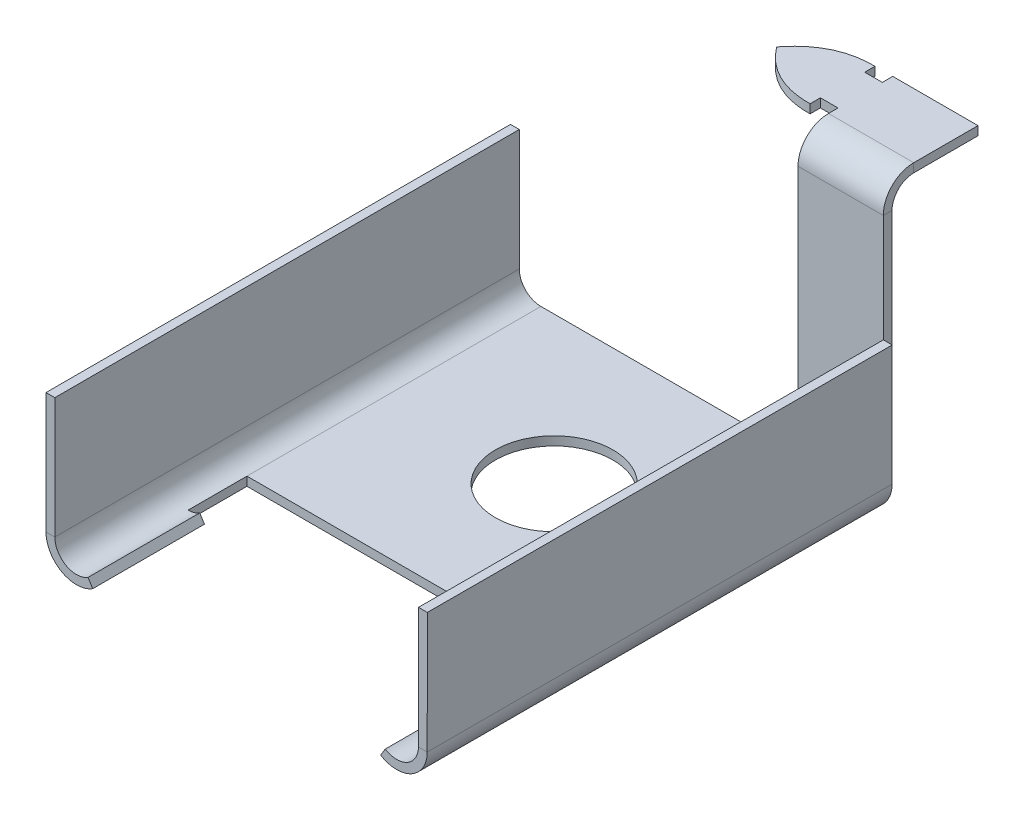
ISO-10303-21;
HEADER;
FILE_DESCRIPTION(('STEP AP214'),'2;1');
FILE_NAME('part.step','',(''),(''),'','','');
FILE_SCHEMA(('AUTOMOTIVE_DESIGN { 1 0 10303 214 1 1 1 1 }'));
ENDSEC;
DATA;
#1=APPLICATION_CONTEXT('core data for automotive mechanical design processes');
#2=APPLICATION_PROTOCOL_DEFINITION('international standard','automotive_design',2000,#1);
#3=PRODUCT_CONTEXT('',#1,'mechanical');
#4=PRODUCT('Part','Part','',(#3));
#5=PRODUCT_RELATED_PRODUCT_CATEGORY('part','',(#4));
#6=PRODUCT_DEFINITION_FORMATION('','',#4);
#7=PRODUCT_DEFINITION_CONTEXT('part definition',#1,'design');
#8=PRODUCT_DEFINITION('design','',#6,#7);
#9=PRODUCT_DEFINITION_SHAPE('','',#8);
#10=(LENGTH_UNIT() NAMED_UNIT(*) SI_UNIT(.MILLI.,.METRE.));
#11=(NAMED_UNIT(*) PLANE_ANGLE_UNIT() SI_UNIT($,.RADIAN.));
#12=(NAMED_UNIT(*) SI_UNIT($,.STERADIAN.) SOLID_ANGLE_UNIT());
#13=UNCERTAINTY_MEASURE_WITH_UNIT(LENGTH_MEASURE(1.E-05),#10,'distance_accuracy_value','');
#14=(GEOMETRIC_REPRESENTATION_CONTEXT(3) GLOBAL_UNCERTAINTY_ASSIGNED_CONTEXT((#13)) GLOBAL_UNIT_ASSIGNED_CONTEXT((#10,
#11,#12)) REPRESENTATION_CONTEXT('',''));
#15=CARTESIAN_POINT('',(0.,0.,0.));
#16=DIRECTION('',(0.,0.,1.));
#17=DIRECTION('',(1.,0.,0.));
#18=AXIS2_PLACEMENT_3D('',#15,#16,#17);
#19=CARTESIAN_POINT('',(0.323399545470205,-0.656068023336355,-6.0366));
#20=DIRECTION('',(1.,0.,0.));
#21=DIRECTION('',(0.,1.,0.));
#22=AXIS2_PLACEMENT_3D('',#19,#20,#21);
#23=PLANE('',#22);
#24=DIRECTION('',(0.,1.,0.));
#25=VECTOR('',#24,1.);
#26=CARTESIAN_POINT('',(0.323399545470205,-0.656068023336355,-6.0366));
#27=LINE('',#26,#25);
#28=CARTESIAN_POINT('',(0.323399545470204,0.736600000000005,-6.0366));
#29=VERTEX_POINT('',#28);
#30=CARTESIAN_POINT('',(0.323399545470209,7.7651491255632,-6.03659999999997));
#31=VERTEX_POINT('',#30);
#32=EDGE_CURVE('E380',#29,#31,#27,.T.);
#33=ORIENTED_EDGE('',*,*,#32,.T.);
#34=DIRECTION('',(0.,0.,1.));
#35=VECTOR('',#34,1.);
#36=CARTESIAN_POINT('',(0.323399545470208,7.7651491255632,-6.03659999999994));
#37=LINE('',#36,#35);
#38=CARTESIAN_POINT('',(0.323399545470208,7.7651491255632,-5.73659999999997));
#39=VERTEX_POINT('',#38);
#40=EDGE_CURVE('E12',#31,#39,#37,.T.);
#41=ORIENTED_EDGE('',*,*,#40,.T.);
#42=DIRECTION('',(0.,1.,0.));
#43=VECTOR('',#42,1.);
#44=CARTESIAN_POINT('',(0.323399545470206,-0.656068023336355,-5.7366));
#45=LINE('',#44,#43);
#46=CARTESIAN_POINT('',(0.323399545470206,0.736600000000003,-5.7366));
#47=VERTEX_POINT('',#46);
#48=EDGE_CURVE('E385',#47,#39,#45,.T.);
#49=ORIENTED_EDGE('',*,*,#48,.F.);
#50=DIRECTION('',(0.,0.,1.));
#51=VECTOR('',#50,1.);
#52=CARTESIAN_POINT('',(0.323399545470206,0.736600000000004,-6.0366));
#53=LINE('',#52,#51);
#54=EDGE_CURVE('E710',#29,#47,#53,.T.);
#55=ORIENTED_EDGE('',*,*,#54,.F.);
#56=EDGE_LOOP('',(#33,#41,#49,#55));
#57=FACE_BOUND('',#56,.T.);
#58=ADVANCED_FACE('F95',(#57),#23,.T.);
#59=CARTESIAN_POINT('',(-2.57660045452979,9.48245307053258,-6.03659999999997));
#60=DIRECTION('',(-1.,0.,0.));
#61=DIRECTION('',(0.,-1.,0.));
#62=AXIS2_PLACEMENT_3D('',#59,#60,#61);
#63=PLANE('',#62);
#64=DIRECTION('',(0.,-1.,0.));
#65=VECTOR('',#64,1.);
#66=CARTESIAN_POINT('',(-2.57660045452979,9.48245307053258,-5.73659999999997));
#67=LINE('',#66,#65);
#68=CARTESIAN_POINT('',(-2.57660045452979,7.7651491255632,-5.73659999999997));
#69=VERTEX_POINT('',#68);
#70=CARTESIAN_POINT('',(-2.57660045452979,0.736600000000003,-5.7366));
#71=VERTEX_POINT('',#70);
#72=EDGE_CURVE('E392',#69,#71,#67,.T.);
#73=ORIENTED_EDGE('',*,*,#72,.F.);
#74=DIRECTION('',(0.,0.,-1.));
#75=VECTOR('',#74,1.);
#76=CARTESIAN_POINT('',(-2.57660045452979,7.7651491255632,-6.03659999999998));
#77=LINE('',#76,#75);
#78=CARTESIAN_POINT('',(-2.57660045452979,7.7651491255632,-6.03659999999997));
#79=VERTEX_POINT('',#78);
#80=EDGE_CURVE('E399',#69,#79,#77,.T.);
#81=ORIENTED_EDGE('',*,*,#80,.T.);
#82=DIRECTION('',(0.,-1.,0.));
#83=VECTOR('',#82,1.);
#84=CARTESIAN_POINT('',(-2.57660045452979,9.48245307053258,-6.03659999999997));
#85=LINE('',#84,#83);
#86=CARTESIAN_POINT('',(-2.57660045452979,0.736600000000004,-6.0366));
#87=VERTEX_POINT('',#86);
#88=EDGE_CURVE('E389',#79,#87,#85,.T.);
#89=ORIENTED_EDGE('',*,*,#88,.T.);
#90=DIRECTION('',(0.,0.,-1.));
#91=VECTOR('',#90,1.);
#92=CARTESIAN_POINT('',(-2.57660045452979,0.736600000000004,-6.0366));
#93=LINE('',#92,#91);
#94=EDGE_CURVE('E393',#71,#87,#93,.T.);
#95=ORIENTED_EDGE('',*,*,#94,.F.);
#96=EDGE_LOOP('',(#73,#81,#89,#95));
#97=FACE_BOUND('',#96,.T.);
#98=ADVANCED_FACE('F699',(#97),#63,.T.);
#99=CARTESIAN_POINT('',(-4.42481809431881,11.0766643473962,-6.03659999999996));
#100=DIRECTION('',(0.,0.,-1.));
#101=DIRECTION('',(0.,1.,0.));
#102=AXIS2_PLACEMENT_3D('',#99,#100,#101);
#103=PLANE('',#102);
#104=ORIENTED_EDGE('',*,*,#88,.F.);
#105=DIRECTION('',(1.,0.,0.));
#106=VECTOR('',#105,1.);
#107=CARTESIAN_POINT('',(-4.42481809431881,7.7651491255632,-6.03659999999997));
#108=LINE('',#107,#106);
#109=EDGE_CURVE('E403',#79,#31,#108,.T.);
#110=ORIENTED_EDGE('',*,*,#109,.T.);
#111=ORIENTED_EDGE('',*,*,#32,.F.);
#112=DIRECTION('',(1.,0.,0.));
#113=VECTOR('',#112,1.);
#114=CARTESIAN_POINT('',(-4.42481809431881,0.736600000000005,-6.0366));
#115=LINE('',#114,#113);
#116=EDGE_CURVE('E374',#87,#29,#115,.T.);
#117=ORIENTED_EDGE('',*,*,#116,.F.);
#118=EDGE_LOOP('',(#104,#110,#111,#117));
#119=FACE_BOUND('',#118,.T.);
#120=ADVANCED_FACE('F705',(#119),#103,.T.);
#121=CARTESIAN_POINT('',(-4.42481809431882,-0.3,-16.7327323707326));
#122=DIRECTION('',(0.,-1.,0.));
#123=DIRECTION('',(0.,0.,-1.));
#124=AXIS2_PLACEMENT_3D('',#121,#122,#123);
#125=PLANE('',#124);
#126=CARTESIAN_POINT('',(-5.13550332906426,-0.3,0.));
#127=DIRECTION('',(0.,1.,0.));
#128=DIRECTION('',(0.,0.,1.));
#129=AXIS2_PLACEMENT_3D('',#126,#127,#128);
#130=CIRCLE('',#129,2.);
#131=CARTESIAN_POINT('',(-5.13550332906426,-0.3,2.));
#132=VERTEX_POINT('',#131);
#133=EDGE_CURVE('E840',#132,#132,#130,.T.);
#134=ORIENTED_EDGE('',*,*,#133,.T.);
#135=EDGE_LOOP('',(#134));
#136=FACE_BOUND('',#135,.T.);
#137=DIRECTION('',(-1.,0.,0.));
#138=VECTOR('',#137,1.);
#139=CARTESIAN_POINT('',(-2.57660045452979,-0.3,-5.));
#140=LINE('',#139,#138);
#141=CARTESIAN_POINT('',(-2.57660045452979,-0.3,-5.));
#142=VERTEX_POINT('',#141);
#143=CARTESIAN_POINT('',(-10.5855033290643,-0.3,-5.));
#144=VERTEX_POINT('',#143);
#145=EDGE_CURVE('E797',#142,#144,#140,.T.);
#146=ORIENTED_EDGE('',*,*,#145,.F.);
#147=DIRECTION('',(1.,0.,0.));
#148=VECTOR('',#147,1.);
#149=CARTESIAN_POINT('',(-4.42481809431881,-0.3,-5.));
#150=LINE('',#149,#148);
#151=CARTESIAN_POINT('',(0.323399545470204,-0.300000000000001,-5.));
#152=VERTEX_POINT('',#151);
#153=EDGE_CURVE('E635',#142,#152,#150,.T.);
#154=ORIENTED_EDGE('',*,*,#153,.T.);
#155=DIRECTION('',(-0.000890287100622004,0.,0.999999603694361));
#156=VECTOR('',#155,1.);
#157=CARTESIAN_POINT('',(0.3338412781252,-0.3,-16.728495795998));
#158=LINE('',#157,#156);
#159=CARTESIAN_POINT('',(0.314496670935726,-0.3,5.00000000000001));
#160=VERTEX_POINT('',#159);
#161=EDGE_CURVE('E771',#152,#160,#158,.T.);
#162=ORIENTED_EDGE('',*,*,#161,.T.);
#163=DIRECTION('',(1.,0.,0.));
#164=VECTOR('',#163,1.);
#165=CARTESIAN_POINT('',(0.314496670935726,-0.3,5.));
#166=LINE('',#165,#164);
#167=CARTESIAN_POINT('',(-10.5855033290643,-0.3,5.));
#168=VERTEX_POINT('',#167);
#169=EDGE_CURVE('E793',#168,#160,#166,.T.);
#170=ORIENTED_EDGE('',*,*,#169,.F.);
#171=DIRECTION('',(0.,0.,1.));
#172=VECTOR('',#171,1.);
#173=CARTESIAN_POINT('',(-10.5855033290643,-0.3,-16.7327323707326));
#174=LINE('',#173,#172);
#175=EDGE_CURVE('E796',#144,#168,#174,.T.);
#176=ORIENTED_EDGE('',*,*,#175,.F.);
#177=EDGE_LOOP('',(#146,#154,#162,#170,#176));
#178=FACE_BOUND('',#177,.T.);
#179=ADVANCED_FACE('F1030',(#136,#178),#125,.T.);
#180=CARTESIAN_POINT('',(-4.42481809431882,0.,-16.7327323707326));
#181=DIRECTION('',(0.,-1.,0.));
#182=DIRECTION('',(0.,0.,-1.));
#183=AXIS2_PLACEMENT_3D('',#180,#181,#182);
#184=PLANE('',#183);
#185=DIRECTION('',(1.,0.,0.));
#186=VECTOR('',#185,1.);
#187=CARTESIAN_POINT('',(-4.42481809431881,0.,-5.));
#188=LINE('',#187,#186);
#189=CARTESIAN_POINT('',(-2.57660045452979,0.,-5.));
#190=VERTEX_POINT('',#189);
#191=CARTESIAN_POINT('',(0.323399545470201,0.,-5.));
#192=VERTEX_POINT('',#191);
#193=EDGE_CURVE('E621',#190,#192,#188,.T.);
#194=ORIENTED_EDGE('',*,*,#193,.F.);
#195=DIRECTION('',(-1.,0.,0.));
#196=VECTOR('',#195,1.);
#197=CARTESIAN_POINT('',(-2.57660045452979,0.,-5.));
#198=LINE('',#197,#196);
#199=CARTESIAN_POINT('',(-10.5855033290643,0.,-5.));
#200=VERTEX_POINT('',#199);
#201=EDGE_CURVE('E829',#190,#200,#198,.T.);
#202=ORIENTED_EDGE('',*,*,#201,.T.);
#203=DIRECTION('',(0.,0.,1.));
#204=VECTOR('',#203,1.);
#205=CARTESIAN_POINT('',(-10.5855033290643,0.,-16.7327323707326));
#206=LINE('',#205,#204);
#207=CARTESIAN_POINT('',(-10.5855033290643,0.,5.));
#208=VERTEX_POINT('',#207);
#209=EDGE_CURVE('E783',#200,#208,#206,.T.);
#210=ORIENTED_EDGE('',*,*,#209,.T.);
#211=DIRECTION('',(1.,0.,0.));
#212=VECTOR('',#211,1.);
#213=CARTESIAN_POINT('',(0.314496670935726,0.,5.));
#214=LINE('',#213,#212);
#215=CARTESIAN_POINT('',(0.314496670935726,0.,5.));
#216=VERTEX_POINT('',#215);
#217=EDGE_CURVE('E821',#208,#216,#214,.T.);
#218=ORIENTED_EDGE('',*,*,#217,.T.);
#219=DIRECTION('',(-0.000890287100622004,0.,0.999999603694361));
#220=VECTOR('',#219,1.);
#221=CARTESIAN_POINT('',(0.3338412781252,0.,-16.728495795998));
#222=LINE('',#221,#220);
#223=EDGE_CURVE('E776',#192,#216,#222,.T.);
#224=ORIENTED_EDGE('',*,*,#223,.F.);
#225=EDGE_LOOP('',(#194,#202,#210,#218,#224));
#226=FACE_BOUND('',#225,.T.);
#227=CARTESIAN_POINT('',(-5.13550332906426,0.,0.));
#228=DIRECTION('',(0.,1.,0.));
#229=DIRECTION('',(0.,0.,1.));
#230=AXIS2_PLACEMENT_3D('',#227,#228,#229);
#231=CIRCLE('',#230,2.);
#232=CARTESIAN_POINT('',(-5.13550332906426,0.,2.));
#233=VERTEX_POINT('',#232);
#234=EDGE_CURVE('E852',#233,#233,#231,.T.);
#235=ORIENTED_EDGE('',*,*,#234,.F.);
#236=EDGE_LOOP('',(#235));
#237=FACE_BOUND('',#236,.T.);
#238=ADVANCED_FACE('F822',(#226,#237),#184,.F.);
#239=CARTESIAN_POINT('',(-2.57660045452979,-0.3,-5.));
#240=DIRECTION('',(0.,0.,-1.));
#241=DIRECTION('',(-1.,0.,0.));
#242=AXIS2_PLACEMENT_3D('',#239,#240,#241);
#243=PLANE('',#242);
#244=DIRECTION('',(0.,-1.,0.));
#245=VECTOR('',#244,1.);
#246=CARTESIAN_POINT('',(-10.5855033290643,-0.3,-5.));
#247=LINE('',#246,#245);
#248=EDGE_CURVE('E777',#200,#144,#247,.T.);
#249=ORIENTED_EDGE('',*,*,#248,.F.);
#250=ORIENTED_EDGE('',*,*,#201,.F.);
#251=DIRECTION('',(0.,1.,0.));
#252=VECTOR('',#251,1.);
#253=CARTESIAN_POINT('',(-2.57660045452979,-0.3,-5.));
#254=LINE('',#253,#252);
#255=EDGE_CURVE('E628',#142,#190,#254,.T.);
#256=ORIENTED_EDGE('',*,*,#255,.F.);
#257=ORIENTED_EDGE('',*,*,#145,.T.);
#258=EDGE_LOOP('',(#249,#250,#256,#257));
#259=FACE_BOUND('',#258,.T.);
#260=ADVANCED_FACE('F1026',(#259),#243,.T.);
#261=CARTESIAN_POINT('',(0.314496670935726,-0.3,5.));
#262=DIRECTION('',(0.,0.,1.));
#263=DIRECTION('',(1.,0.,0.));
#264=AXIS2_PLACEMENT_3D('',#261,#262,#263);
#265=PLANE('',#264);
#266=ORIENTED_EDGE('',*,*,#217,.F.);
#267=DIRECTION('',(0.,1.,0.));
#268=VECTOR('',#267,1.);
#269=CARTESIAN_POINT('',(-10.5855033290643,-0.3,5.));
#270=LINE('',#269,#268);
#271=EDGE_CURVE('E846',#168,#208,#270,.T.);
#272=ORIENTED_EDGE('',*,*,#271,.F.);
#273=ORIENTED_EDGE('',*,*,#169,.T.);
#274=CARTESIAN_POINT('',(0.314496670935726,0.,5.00000000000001));
#275=CARTESIAN_POINT('',(0.314496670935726,-0.3,5.00000000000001));
#276=B_SPLINE_CURVE_WITH_KNOTS('',1,(#274,#275),.UNSPECIFIED.,.F.,.F.,(2,2),(0.,1.),.UNSPECIFIED.);
#277=EDGE_CURVE('E641',#160,#216,#276,.F.);
#278=ORIENTED_EDGE('',*,*,#277,.T.);
#279=EDGE_LOOP('',(#266,#272,#273,#278));
#280=FACE_BOUND('',#279,.T.);
#281=ADVANCED_FACE('F831',(#280),#265,.T.);
#282=CARTESIAN_POINT('',(-5.13550332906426,-0.3,0.));
#283=DIRECTION('',(0.,1.,0.));
#284=DIRECTION('',(0.,0.,1.));
#285=AXIS2_PLACEMENT_3D('',#282,#283,#284);
#286=CYLINDRICAL_SURFACE('',#285,2.);
#287=ORIENTED_EDGE('',*,*,#133,.F.);
#288=EDGE_LOOP('',(#287));
#289=FACE_BOUND('',#288,.T.);
#290=ORIENTED_EDGE('',*,*,#234,.T.);
#291=EDGE_LOOP('',(#290));
#292=FACE_BOUND('',#291,.T.);
#293=ADVANCED_FACE('F1016',(#289,#292),#286,.F.);
#294=CARTESIAN_POINT('',(-10.5855033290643,0.7366,-5.));
#295=DIRECTION('',(0.,0.,-1.));
#296=DIRECTION('',(-1.,0.,0.));
#297=AXIS2_PLACEMENT_3D('',#294,#295,#296);
#298=PLANE('',#297);
#299=DIRECTION('',(-1.,0.,0.));
#300=VECTOR('',#299,1.);
#301=CARTESIAN_POINT('',(-11.6221033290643,0.736600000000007,-5.));
#302=LINE('',#301,#300);
#303=CARTESIAN_POINT('',(-11.3221033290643,0.736600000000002,-5.));
#304=VERTEX_POINT('',#303);
#305=CARTESIAN_POINT('',(-11.6221033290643,0.736600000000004,-5.));
#306=VERTEX_POINT('',#305);
#307=EDGE_CURVE('E940',#304,#306,#302,.T.);
#308=ORIENTED_EDGE('',*,*,#307,.F.);
#309=CARTESIAN_POINT('',(-10.5855033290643,0.7366,-5.));
#310=DIRECTION('',(0.,0.,-1.));
#311=DIRECTION('',(-1.,0.,0.));
#312=AXIS2_PLACEMENT_3D('',#309,#310,#311);
#313=CIRCLE('',#312,0.7366);
#314=EDGE_CURVE('E876',#304,#200,#313,.F.);
#315=ORIENTED_EDGE('',*,*,#314,.T.);
#316=ORIENTED_EDGE('',*,*,#248,.T.);
#317=CARTESIAN_POINT('',(-10.5855033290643,0.7366,-5.));
#318=DIRECTION('',(0.,0.,1.));
#319=DIRECTION('',(-1.,0.,0.));
#320=AXIS2_PLACEMENT_3D('',#317,#318,#319);
#321=CIRCLE('',#320,1.0366);
#322=EDGE_CURVE('E874',#306,#144,#321,.T.);
#323=ORIENTED_EDGE('',*,*,#322,.F.);
#324=EDGE_LOOP('',(#308,#315,#316,#323));
#325=FACE_BOUND('',#324,.T.);
#326=ADVANCED_FACE('F1012',(#325),#298,.T.);
#327=CARTESIAN_POINT('',(-10.5855033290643,-0.3,1.));
#328=DIRECTION('',(1.,0.,0.));
#329=DIRECTION('',(0.,0.,1.));
#330=AXIS2_PLACEMENT_3D('',#327,#328,#329);
#331=PLANE('',#330);
#332=DIRECTION('',(0.,0.,1.));
#333=VECTOR('',#332,1.);
#334=CARTESIAN_POINT('',(-10.5855033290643,-0.3,-5.));
#335=LINE('',#334,#333);
#336=CARTESIAN_POINT('',(-10.5855033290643,-0.3,7.));
#337=VERTEX_POINT('',#336);
#338=EDGE_CURVE('E902',#168,#337,#335,.T.);
#339=ORIENTED_EDGE('',*,*,#338,.F.);
#340=ORIENTED_EDGE('',*,*,#271,.T.);
#341=DIRECTION('',(0.,0.,-1.));
#342=VECTOR('',#341,1.);
#343=CARTESIAN_POINT('',(-10.5855033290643,0.,16.9157843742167));
#344=LINE('',#343,#342);
#345=CARTESIAN_POINT('',(-10.5855033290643,0.,7.));
#346=VERTEX_POINT('',#345);
#347=EDGE_CURVE('E880',#208,#346,#344,.F.);
#348=ORIENTED_EDGE('',*,*,#347,.T.);
#349=DIRECTION('',(0.,-1.,0.));
#350=VECTOR('',#349,1.);
#351=CARTESIAN_POINT('',(-10.5855033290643,-0.3,7.));
#352=LINE('',#351,#350);
#353=EDGE_CURVE('E856',#346,#337,#352,.T.);
#354=ORIENTED_EDGE('',*,*,#353,.T.);
#355=EDGE_LOOP('',(#339,#340,#348,#354));
#356=FACE_BOUND('',#355,.T.);
#357=ADVANCED_FACE('F1008',(#356),#331,.T.);
#358=CARTESIAN_POINT('',(-10.5855033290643,0.7366,7.));
#359=DIRECTION('',(0.,0.,-1.));
#360=DIRECTION('',(-1.,0.,0.));
#361=AXIS2_PLACEMENT_3D('',#358,#359,#360);
#362=PLANE('',#361);
#363=ORIENTED_EDGE('',*,*,#353,.F.);
#364=CARTESIAN_POINT('',(-10.5855033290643,0.7366,7.));
#365=DIRECTION('',(0.,0.,-1.));
#366=DIRECTION('',(-1.,0.,0.));
#367=AXIS2_PLACEMENT_3D('',#364,#365,#366);
#368=CIRCLE('',#367,0.7366);
#369=CARTESIAN_POINT('',(-10.1917681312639,0.114063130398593,7.));
#370=VERTEX_POINT('',#369);
#371=EDGE_CURVE('E884',#346,#370,#368,.F.);
#372=ORIENTED_EDGE('',*,*,#371,.T.);
#373=DIRECTION('',(0.534530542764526,-0.845149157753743,0.));
#374=VECTOR('',#373,1.);
#375=CARTESIAN_POINT('',(-10.0314089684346,-0.13948161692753,7.));
#376=LINE('',#375,#374);
#377=CARTESIAN_POINT('',(-10.0314089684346,-0.13948161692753,7.));
#378=VERTEX_POINT('',#377);
#379=EDGE_CURVE('E863',#370,#378,#376,.T.);
#380=ORIENTED_EDGE('',*,*,#379,.T.);
#381=CARTESIAN_POINT('',(-10.5855033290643,0.7366,7.));
#382=DIRECTION('',(0.,0.,1.));
#383=DIRECTION('',(-1.,0.,0.));
#384=AXIS2_PLACEMENT_3D('',#381,#382,#383);
#385=CIRCLE('',#384,1.0366);
#386=EDGE_CURVE('E898',#337,#378,#385,.T.);
#387=ORIENTED_EDGE('',*,*,#386,.F.);
#388=EDGE_LOOP('',(#363,#372,#380,#387));
#389=FACE_BOUND('',#388,.T.);
#390=ADVANCED_FACE('F1004',(#389),#362,.T.);
#391=CARTESIAN_POINT('',(-10.0314089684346,-0.13948161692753,8.9));
#392=DIRECTION('',(0.845149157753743,0.534530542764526,0.));
#393=DIRECTION('',(0.,0.,1.));
#394=AXIS2_PLACEMENT_3D('',#391,#392,#393);
#395=PLANE('',#394);
#396=ORIENTED_EDGE('',*,*,#379,.F.);
#397=DIRECTION('',(0.,0.,-1.));
#398=VECTOR('',#397,1.);
#399=CARTESIAN_POINT('',(-10.1917681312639,0.114063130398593,16.9157843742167));
#400=LINE('',#399,#398);
#401=CARTESIAN_POINT('',(-10.1917681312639,0.114063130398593,10.8));
#402=VERTEX_POINT('',#401);
#403=EDGE_CURVE('E875',#370,#402,#400,.F.);
#404=ORIENTED_EDGE('',*,*,#403,.T.);
#405=DIRECTION('',(0.534530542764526,-0.845149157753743,0.));
#406=VECTOR('',#405,1.);
#407=CARTESIAN_POINT('',(-10.0314089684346,-0.13948161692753,10.8));
#408=LINE('',#407,#406);
#409=CARTESIAN_POINT('',(-10.0314089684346,-0.13948161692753,10.8));
#410=VERTEX_POINT('',#409);
#411=EDGE_CURVE('E860',#402,#410,#408,.T.);
#412=ORIENTED_EDGE('',*,*,#411,.T.);
#413=DIRECTION('',(0.,0.,1.));
#414=VECTOR('',#413,1.);
#415=CARTESIAN_POINT('',(-10.0314089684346,-0.13948161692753,10.8));
#416=LINE('',#415,#414);
#417=EDGE_CURVE('E894',#378,#410,#416,.T.);
#418=ORIENTED_EDGE('',*,*,#417,.F.);
#419=EDGE_LOOP('',(#396,#404,#412,#418));
#420=FACE_BOUND('',#419,.T.);
#421=ADVANCED_FACE('F1001',(#420),#395,.T.);
#422=CARTESIAN_POINT('',(-10.5855033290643,0.7366,10.8));
#423=DIRECTION('',(0.,0.,1.));
#424=DIRECTION('',(1.,0.,0.));
#425=AXIS2_PLACEMENT_3D('',#422,#423,#424);
#426=PLANE('',#425);
#427=CARTESIAN_POINT('',(-10.5855033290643,0.7366,10.8));
#428=DIRECTION('',(0.,0.,-1.));
#429=DIRECTION('',(-1.,0.,0.));
#430=AXIS2_PLACEMENT_3D('',#427,#428,#429);
#431=CIRCLE('',#430,0.7366);
#432=CARTESIAN_POINT('',(-11.3221033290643,0.736600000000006,10.8));
#433=VERTEX_POINT('',#432);
#434=EDGE_CURVE('E870',#402,#433,#431,.T.);
#435=ORIENTED_EDGE('',*,*,#434,.T.);
#436=DIRECTION('',(1.,0.,0.));
#437=VECTOR('',#436,1.);
#438=CARTESIAN_POINT('',(-11.6221033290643,0.736600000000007,10.8));
#439=LINE('',#438,#437);
#440=CARTESIAN_POINT('',(-11.6221033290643,0.736600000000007,10.8));
#441=VERTEX_POINT('',#440);
#442=EDGE_CURVE('E926',#441,#433,#439,.T.);
#443=ORIENTED_EDGE('',*,*,#442,.F.);
#444=CARTESIAN_POINT('',(-10.5855033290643,0.7366,10.8));
#445=DIRECTION('',(0.,0.,-1.));
#446=DIRECTION('',(1.,0.,0.));
#447=AXIS2_PLACEMENT_3D('',#444,#445,#446);
#448=CIRCLE('',#447,1.0366);
#449=EDGE_CURVE('E864',#410,#441,#448,.T.);
#450=ORIENTED_EDGE('',*,*,#449,.F.);
#451=ORIENTED_EDGE('',*,*,#411,.F.);
#452=EDGE_LOOP('',(#435,#443,#450,#451));
#453=FACE_BOUND('',#452,.T.);
#454=ADVANCED_FACE('F996',(#453),#426,.T.);
#455=CARTESIAN_POINT('',(-10.5855033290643,0.7366,16.9157843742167));
#456=DIRECTION('',(0.,0.,-1.));
#457=DIRECTION('',(-1.,0.,0.));
#458=AXIS2_PLACEMENT_3D('',#455,#456,#457);
#459=CYLINDRICAL_SURFACE('',#458,1.0366);
#460=ORIENTED_EDGE('',*,*,#417,.T.);
#461=ORIENTED_EDGE('',*,*,#449,.T.);
#462=DIRECTION('',(0.,0.,1.));
#463=VECTOR('',#462,1.);
#464=CARTESIAN_POINT('',(-11.6221033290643,0.736600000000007,-16.7327323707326));
#465=LINE('',#464,#463);
#466=EDGE_CURVE('E919',#306,#441,#465,.T.);
#467=ORIENTED_EDGE('',*,*,#466,.F.);
#468=ORIENTED_EDGE('',*,*,#322,.T.);
#469=ORIENTED_EDGE('',*,*,#175,.T.);
#470=ORIENTED_EDGE('',*,*,#338,.T.);
#471=ORIENTED_EDGE('',*,*,#386,.T.);
#472=EDGE_LOOP('',(#460,#461,#467,#468,#469,#470,#471));
#473=FACE_BOUND('',#472,.T.);
#474=ADVANCED_FACE('F993',(#473),#459,.T.);
#475=CARTESIAN_POINT('',(-10.5855033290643,0.7366,16.9157843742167));
#476=DIRECTION('',(0.,0.,-1.));
#477=DIRECTION('',(-1.,0.,0.));
#478=AXIS2_PLACEMENT_3D('',#475,#476,#477);
#479=CYLINDRICAL_SURFACE('',#478,0.7366);
#480=ORIENTED_EDGE('',*,*,#403,.F.);
#481=ORIENTED_EDGE('',*,*,#371,.F.);
#482=ORIENTED_EDGE('',*,*,#347,.F.);
#483=ORIENTED_EDGE('',*,*,#209,.F.);
#484=ORIENTED_EDGE('',*,*,#314,.F.);
#485=DIRECTION('',(0.,0.,1.));
#486=VECTOR('',#485,1.);
#487=CARTESIAN_POINT('',(-11.3221033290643,0.736600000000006,-16.7327323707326));
#488=LINE('',#487,#486);
#489=EDGE_CURVE('E908',#304,#433,#488,.T.);
#490=ORIENTED_EDGE('',*,*,#489,.T.);
#491=ORIENTED_EDGE('',*,*,#434,.F.);
#492=EDGE_LOOP('',(#480,#481,#482,#483,#484,#490,#491));
#493=FACE_BOUND('',#492,.T.);
#494=ADVANCED_FACE('F977',(#493),#479,.F.);
#495=CARTESIAN_POINT('',(-11.6221033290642,4.84393197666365,-5.));
#496=DIRECTION('',(0.,1.,0.));
#497=DIRECTION('',(0.,0.,1.));
#498=AXIS2_PLACEMENT_3D('',#495,#496,#497);
#499=PLANE('',#498);
#500=DIRECTION('',(0.,0.,1.));
#501=VECTOR('',#500,1.);
#502=CARTESIAN_POINT('',(-11.3221033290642,4.84393197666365,-5.));
#503=LINE('',#502,#501);
#504=CARTESIAN_POINT('',(-11.3221033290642,4.84393197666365,-5.));
#505=VERTEX_POINT('',#504);
#506=CARTESIAN_POINT('',(-11.3221033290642,4.84393197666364,10.8));
#507=VERTEX_POINT('',#506);
#508=EDGE_CURVE('E933',#505,#507,#503,.T.);
#509=ORIENTED_EDGE('',*,*,#508,.F.);
#510=DIRECTION('',(1.,0.,0.));
#511=VECTOR('',#510,1.);
#512=CARTESIAN_POINT('',(-11.6221033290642,4.84393197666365,-5.));
#513=LINE('',#512,#511);
#514=CARTESIAN_POINT('',(-11.6221033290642,4.84393197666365,-5.));
#515=VERTEX_POINT('',#514);
#516=EDGE_CURVE('E881',#515,#505,#513,.T.);
#517=ORIENTED_EDGE('',*,*,#516,.F.);
#518=DIRECTION('',(0.,0.,1.));
#519=VECTOR('',#518,1.);
#520=CARTESIAN_POINT('',(-11.6221033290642,4.84393197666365,-5.));
#521=LINE('',#520,#519);
#522=CARTESIAN_POINT('',(-11.6221033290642,4.84393197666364,10.8));
#523=VERTEX_POINT('',#522);
#524=EDGE_CURVE('E912',#515,#523,#521,.T.);
#525=ORIENTED_EDGE('',*,*,#524,.T.);
#526=DIRECTION('',(1.,0.,0.));
#527=VECTOR('',#526,1.);
#528=CARTESIAN_POINT('',(-11.6221033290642,4.84393197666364,10.8));
#529=LINE('',#528,#527);
#530=EDGE_CURVE('E916',#523,#507,#529,.T.);
#531=ORIENTED_EDGE('',*,*,#530,.T.);
#532=EDGE_LOOP('',(#509,#517,#525,#531));
#533=FACE_BOUND('',#532,.T.);
#534=ADVANCED_FACE('F968',(#533),#499,.T.);
#535=CARTESIAN_POINT('',(-11.6221033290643,-6.8167532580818,-16.7327323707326));
#536=DIRECTION('',(-1.,0.,0.));
#537=DIRECTION('',(0.,0.,-1.));
#538=AXIS2_PLACEMENT_3D('',#535,#536,#537);
#539=PLANE('',#538);
#540=DIRECTION('',(0.,1.,0.));
#541=VECTOR('',#540,1.);
#542=CARTESIAN_POINT('',(-11.6221033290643,-8.66497089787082,-5.));
#543=LINE('',#542,#541);
#544=EDGE_CURVE('E943',#306,#515,#543,.T.);
#545=ORIENTED_EDGE('',*,*,#544,.F.);
#546=ORIENTED_EDGE('',*,*,#466,.T.);
#547=DIRECTION('',(0.,-1.,0.));
#548=VECTOR('',#547,1.);
#549=CARTESIAN_POINT('',(-11.6221033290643,-1.15606802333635,10.8));
#550=LINE('',#549,#548);
#551=EDGE_CURVE('E922',#523,#441,#550,.T.);
#552=ORIENTED_EDGE('',*,*,#551,.F.);
#553=ORIENTED_EDGE('',*,*,#524,.F.);
#554=EDGE_LOOP('',(#545,#546,#552,#553));
#555=FACE_BOUND('',#554,.T.);
#556=ADVANCED_FACE('F976',(#555),#539,.T.);
#557=CARTESIAN_POINT('',(-11.6221033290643,-1.15606802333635,10.8));
#558=DIRECTION('',(0.,0.,1.));
#559=DIRECTION('',(0.,-1.,0.));
#560=AXIS2_PLACEMENT_3D('',#557,#558,#559);
#561=PLANE('',#560);
#562=ORIENTED_EDGE('',*,*,#551,.T.);
#563=ORIENTED_EDGE('',*,*,#442,.T.);
#564=DIRECTION('',(0.,-1.,0.));
#565=VECTOR('',#564,1.);
#566=CARTESIAN_POINT('',(-11.3221033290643,-1.15606802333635,10.8));
#567=LINE('',#566,#565);
#568=EDGE_CURVE('E937',#507,#433,#567,.T.);
#569=ORIENTED_EDGE('',*,*,#568,.F.);
#570=ORIENTED_EDGE('',*,*,#530,.F.);
#571=EDGE_LOOP('',(#562,#563,#569,#570));
#572=FACE_BOUND('',#571,.T.);
#573=ADVANCED_FACE('F981',(#572),#561,.T.);
#574=CARTESIAN_POINT('',(-11.3221033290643,-6.8167532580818,-16.7327323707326));
#575=DIRECTION('',(-1.,0.,0.));
#576=DIRECTION('',(0.,0.,-1.));
#577=AXIS2_PLACEMENT_3D('',#574,#575,#576);
#578=PLANE('',#577);
#579=ORIENTED_EDGE('',*,*,#489,.F.);
#580=DIRECTION('',(0.,1.,0.));
#581=VECTOR('',#580,1.);
#582=CARTESIAN_POINT('',(-11.3221033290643,-8.66497089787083,-5.));
#583=LINE('',#582,#581);
#584=EDGE_CURVE('E930',#304,#505,#583,.T.);
#585=ORIENTED_EDGE('',*,*,#584,.T.);
#586=ORIENTED_EDGE('',*,*,#508,.T.);
#587=ORIENTED_EDGE('',*,*,#568,.T.);
#588=EDGE_LOOP('',(#579,#585,#586,#587));
#589=FACE_BOUND('',#588,.T.);
#590=ADVANCED_FACE('F985',(#589),#578,.F.);
#591=CARTESIAN_POINT('',(-11.6221033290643,-8.66497089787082,-5.));
#592=DIRECTION('',(0.,0.,-1.));
#593=DIRECTION('',(0.,1.,0.));
#594=AXIS2_PLACEMENT_3D('',#591,#592,#593);
#595=PLANE('',#594);
#596=ORIENTED_EDGE('',*,*,#584,.F.);
#597=ORIENTED_EDGE('',*,*,#307,.T.);
#598=ORIENTED_EDGE('',*,*,#544,.T.);
#599=ORIENTED_EDGE('',*,*,#516,.T.);
#600=EDGE_LOOP('',(#596,#597,#598,#599));
#601=FACE_BOUND('',#600,.T.);
#602=ADVANCED_FACE('F967',(#601),#595,.T.);
#603=CARTESIAN_POINT('',(0.323399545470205,-0.30303,-5.));
#604=CARTESIAN_POINT('',(0.459511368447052,-0.30303,-4.99998216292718));
#605=CARTESIAN_POINT('',(0.595520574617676,-0.275971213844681,-4.99996437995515));
#606=CARTESIAN_POINT('',(0.846977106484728,-0.171814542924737,-4.99994715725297));
#607=CARTESIAN_POINT('',(0.962300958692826,-0.0947576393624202,-4.99994780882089));
#608=CARTESIAN_POINT('',(1.15475749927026,0.097698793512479,-4.9999831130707));
#609=CARTESIAN_POINT('',(1.23181446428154,0.213022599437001,-5.00001783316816));
#610=CARTESIAN_POINT('',(1.33597127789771,0.464479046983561,-5.00013174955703));
#611=CARTESIAN_POINT('',(1.36303014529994,0.60048821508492,-5.00021096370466));
#612=CARTESIAN_POINT('',(1.36303023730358,0.7366,-5.0003143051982));
#613=CARTESIAN_POINT('',(0.323399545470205,-0.3,-5.));
#614=CARTESIAN_POINT('',(0.45911467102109,-0.3,-4.99998251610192));
#615=CARTESIAN_POINT('',(0.594727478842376,-0.273020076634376,-4.99996508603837));
#616=CARTESIAN_POINT('',(0.845451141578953,-0.169166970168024,-4.99994851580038));
#617=CARTESIAN_POINT('',(0.960438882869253,-0.0923346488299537,-4.99994946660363));
#618=CARTESIAN_POINT('',(1.15233450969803,0.099560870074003,-4.99998527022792));
#619=CARTESIAN_POINT('',(1.22916689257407,0.214548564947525,-5.00002019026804));
#620=CARTESIAN_POINT('',(1.33302014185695,0.465272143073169,-5.00013437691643));
#621=CARTESIAN_POINT('',(1.36000014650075,0.600884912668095,-5.00021366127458));
#622=CARTESIAN_POINT('',(1.36000023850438,0.7366,-5.00031700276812));
#623=CARTESIAN_POINT('',(0.323399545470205,0.,-5.));
#624=CARTESIAN_POINT('',(0.419837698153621,0.,-5.00001748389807));
#625=CARTESIAN_POINT('',(0.516203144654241,0.0191717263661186,-5.00003499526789));
#626=CARTESIAN_POINT('',(0.694365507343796,0.0929689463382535,-5.00008302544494));
#627=CARTESIAN_POINT('',(0.776074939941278,0.1475654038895,-5.00011360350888));
#628=CARTESIAN_POINT('',(0.912434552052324,0.283924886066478,-5.00019885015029));
#629=CARTESIAN_POINT('',(0.967031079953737,0.365634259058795,-5.00025356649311));
#630=CARTESIAN_POINT('',(1.04082845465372,0.543796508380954,-5.00039451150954));
#631=CARTESIAN_POINT('',(1.06000026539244,0.640161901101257,-5.00048074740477));
#632=CARTESIAN_POINT('',(1.06000035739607,0.7366,-5.0005840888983));
#633=CARTESIAN_POINT('',(0.323399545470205,0.00299999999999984,-5.));
#634=CARTESIAN_POINT('',(0.419444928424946,0.00299999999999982,-5.00001783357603));
#635=CARTESIAN_POINT('',(0.51541790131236,0.0220936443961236,-5.00003569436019));
#636=CARTESIAN_POINT('',(0.692854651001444,0.0955903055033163,-5.00008437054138));
#637=CARTESIAN_POINT('',(0.774231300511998,0.149964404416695,-5.00011524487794));
#638=CARTESIAN_POINT('',(0.910035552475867,0.285768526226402,-5.00020098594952));
#639=CARTESIAN_POINT('',(0.964409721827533,0.367145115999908,-5.00025590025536));
#640=CARTESIAN_POINT('',(1.03790653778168,0.544581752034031,-5.00039711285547));
#641=CARTESIAN_POINT('',(1.05700026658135,0.640554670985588,-5.00048341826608));
#642=CARTESIAN_POINT('',(1.05700035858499,0.7366,-5.0005867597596));
#643=B_SPLINE_SURFACE_WITH_KNOTS('',1,3,((#603,#604,#605,#606,#607,#608,#609,#610,#611,#612),
(#613,#614,#615,#616,#617,#618,#619,#620,#621,#622),(#623,#624,#625,#626,#627,#628,#629,#630,
#631,#632),(#633,#634,#635,#636,#637,#638,#639,#640,#641,#642)),.UNSPECIFIED.,.F.,.F.,.F.,(2,1,
1,2),(4,2,2,2,4),(-0.0101,0.,1.,1.01),(0.,0.25,0.5,0.75,1.),.UNSPECIFIED.);
#644=DIRECTION('',(0.,1.,0.));
#645=VECTOR('',#644,1.);
#646=CARTESIAN_POINT('',(0.323399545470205,0.,-5.));
#647=LINE('',#646,#645);
#648=CARTESIAN_POINT('',(0.323399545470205,-0.149999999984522,-5.));
#649=VERTEX_POINT('',#648);
#650=EDGE_CURVE('E407',#152,#649,#647,.T.);
#651=DIRECTION('',(0.,1.,0.));
#652=VECTOR('',#651,1.);
#653=CARTESIAN_POINT('',(0.323399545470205,0.,-5.));
#654=LINE('',#653,#652);
#655=EDGE_CURVE('E119',#649,#192,#654,.T.);
#656=CARTESIAN_POINT('',(0.323399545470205,0.,-5.));
#657=CARTESIAN_POINT('',(0.335452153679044,-2.55665591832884E-07,-5.00000218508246));
#658=CARTESIAN_POINT('',(0.347504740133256,0.000295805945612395,-5.00000437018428));
#659=CARTESIAN_POINT('',(0.371580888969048,0.00147872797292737,-5.0000087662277));
#660=CARTESIAN_POINT('',(0.383604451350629,0.00236558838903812,-5.00001097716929));
#661=CARTESIAN_POINT('',(0.407593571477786,0.00472827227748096,-5.00001545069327));
#662=CARTESIAN_POINT('',(0.419559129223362,0.00620409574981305,-5.00001771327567));
#663=CARTESIAN_POINT('',(0.443403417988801,0.00974106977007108,-5.00002231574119));
#664=CARTESIAN_POINT('',(0.455282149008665,0.011802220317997,-5.00002465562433));
#665=CARTESIAN_POINT('',(0.478924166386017,0.0165049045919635,-5.00002943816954));
#666=CARTESIAN_POINT('',(0.490687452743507,0.0191464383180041,-5.00003188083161));
#667=CARTESIAN_POINT('',(0.514070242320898,0.0250035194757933,-5.00003689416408));
#668=CARTESIAN_POINT('',(0.525689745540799,0.028219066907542,-5.00003946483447));
#669=CARTESIAN_POINT('',(0.548756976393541,0.0352164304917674,-5.00004475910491));
#670=CARTESIAN_POINT('',(0.560204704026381,0.0389982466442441,-5.00004748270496));
#671=CARTESIAN_POINT('',(0.582900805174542,0.0471190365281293,-5.00005310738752));
#672=CARTESIAN_POINT('',(0.594149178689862,0.0514580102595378,-5.00005600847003));
#673=CARTESIAN_POINT('',(0.616419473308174,0.0606826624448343,-5.0000620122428));
#674=CARTESIAN_POINT('',(0.627441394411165,0.0655683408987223,-5.00006511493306));
#675=CARTESIAN_POINT('',(0.649232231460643,0.0758746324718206,-5.00007154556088));
#676=CARTESIAN_POINT('',(0.660001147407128,0.081295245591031,-5.00007487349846));
#677=CARTESIAN_POINT('',(0.681260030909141,0.0926583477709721,-5.00008177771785));
#678=CARTESIAN_POINT('',(0.691749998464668,0.0986008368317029,-5.00008535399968));
#679=CARTESIAN_POINT('',(0.712425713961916,0.110993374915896,-5.00009277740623));
#680=CARTESIAN_POINT('',(0.722611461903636,0.117443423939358,-5.00009662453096));
#681=CARTESIAN_POINT('',(0.742654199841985,0.130835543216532,-5.0001046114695));
#682=CARTESIAN_POINT('',(0.752511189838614,0.137777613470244,-5.0001087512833));
#683=CARTESIAN_POINT('',(0.771872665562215,0.152137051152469,-5.00011734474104));
#684=CARTESIAN_POINT('',(0.781377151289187,0.159554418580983,-5.00012179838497));
#685=CARTESIAN_POINT('',(0.800010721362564,0.174846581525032,-5.00013103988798));
#686=CARTESIAN_POINT('',(0.809139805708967,0.182721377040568,-5.00013582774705));
#687=CARTESIAN_POINT('',(0.827000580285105,0.198909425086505,-5.00014575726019));
#688=CARTESIAN_POINT('',(0.835732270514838,0.207222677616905,-5.00015089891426));
#689=CARTESIAN_POINT('',(0.852777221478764,0.224267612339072,-5.00016155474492));
#690=CARTESIAN_POINT('',(0.861090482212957,0.232999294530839,-5.00016706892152));
#691=CARTESIAN_POINT('',(0.877278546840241,0.250860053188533,-5.00017848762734));
#692=CARTESIAN_POINT('',(0.885153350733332,0.259989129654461,-5.00018439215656));
#693=CARTESIAN_POINT('',(0.900445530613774,0.278622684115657,-5.00019660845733));
#694=CARTESIAN_POINT('',(0.907862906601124,0.288127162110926,-5.00020292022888));
#695=CARTESIAN_POINT('',(0.922222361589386,0.30748862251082,-5.00021596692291));
#696=CARTESIAN_POINT('',(0.929164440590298,0.317345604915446,-5.00022270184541));
#697=CARTESIAN_POINT('',(0.942556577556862,0.337388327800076,-5.00023660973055));
#698=CARTESIAN_POINT('',(0.949006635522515,0.347574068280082,-5.00024378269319));
#699=CARTESIAN_POINT('',(0.961399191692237,0.368249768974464,-5.00025858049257));
#700=CARTESIAN_POINT('',(0.967341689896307,0.37873972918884,-5.0002662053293));
#701=CARTESIAN_POINT('',(0.978704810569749,0.3999985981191,-5.00028191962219));
#702=CARTESIAN_POINT('',(0.984125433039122,0.410767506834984,-5.00029000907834));
#703=CARTESIAN_POINT('',(0.994431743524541,0.432558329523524,-5.00030666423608));
#704=CARTESIAN_POINT('',(0.999317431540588,0.443580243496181,-5.00031522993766));
#705=CARTESIAN_POINT('',(1.00854210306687,0.465850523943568,-5.00033284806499));
#706=CARTESIAN_POINT('',(1.0128810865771,0.477098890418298,-5.00034190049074));
#707=CARTESIAN_POINT('',(1.02100189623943,0.499794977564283,-5.00036050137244));
#708=CARTESIAN_POINT('',(1.02478372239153,0.511242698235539,-5.00037004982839));
#709=CARTESIAN_POINT('',(1.03178110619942,0.534309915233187,-5.00038965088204));
#710=CARTESIAN_POINT('',(1.03499666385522,0.545929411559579,-5.00039970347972));
#711=CARTESIAN_POINT('',(1.04085376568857,0.569312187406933,-5.0004203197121));
#712=CARTESIAN_POINT('',(1.04349530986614,0.581075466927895,-5.00043088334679));
#713=CARTESIAN_POINT('',(1.04819801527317,0.604717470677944,-5.00045252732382));
#714=CARTESIAN_POINT('',(1.05025917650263,0.616596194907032,-5.00046360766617));
#715=CARTESIAN_POINT('',(1.05379617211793,0.640440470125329,-5.00048628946));
#716=CARTESIAN_POINT('',(1.05527200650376,0.652406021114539,-5.00049789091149));
#717=CARTESIAN_POINT('',(1.05763471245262,0.676395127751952,-5.00052161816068));
#718=CARTESIAN_POINT('',(1.05852158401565,0.688418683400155,-5.00053374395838));
#719=CARTESIAN_POINT('',(1.05970452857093,0.712494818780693,-5.00055852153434));
#720=CARTESIAN_POINT('',(1.06000060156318,0.724547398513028,-5.0005711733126));
#721=CARTESIAN_POINT('',(1.06000035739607,0.7366,-5.0005840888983));
#722=B_SPLINE_CURVE_WITH_KNOTS('',3,(#656,#657,#658,#659,#660,#661,#662,#663,#664,#665,#666,
#667,#668,#669,#670,#671,#672,#673,#674,#675,#676,#677,#678,#679,#680,#681,#682,#683,#684,#685,
#686,#687,#688,#689,#690,#691,#692,#693,#694,#695,#696,#697,#698,#699,#700,#701,#702,#703,#704,
#705,#706,#707,#708,#709,#710,#711,#712,#713,#714,#715,#716,#717,#718,#719,#720,#721),
.UNSPECIFIED.,.F.,.F.,(4,2,2,2,2,2,2,2,2,2,2,2,2,2,2,2,2,2,2,2,2,2,2,2,2,2,2,2,2,2,2,2,4),(0.,
0.0361541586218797,0.0723083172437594,0.108462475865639,0.14461663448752,0.180770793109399,
0.216924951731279,0.253079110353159,0.289233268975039,0.325387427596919,0.361541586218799,
0.397695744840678,0.433849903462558,0.470004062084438,0.506158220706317,0.542312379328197,
0.578466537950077,0.614620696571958,0.650774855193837,0.686929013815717,0.723083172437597,
0.759237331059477,0.795391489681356,0.831545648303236,0.867699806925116,0.903853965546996,
0.940008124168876,0.976162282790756,1.01231644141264,1.04847060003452,1.08462475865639,
1.12077891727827,1.15693307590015),.UNSPECIFIED.);
#723=CARTESIAN_POINT('',(1.06000035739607,0.736600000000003,-5.00058408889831));
#724=VERTEX_POINT('',#723);
#725=EDGE_CURVE('E606',#192,#724,#722,.T.);
#726=CARTESIAN_POINT('',(1.05700035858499,0.7366,-5.0005867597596));
#727=CARTESIAN_POINT('',(1.06000035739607,0.7366,-5.0005840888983));
#728=CARTESIAN_POINT('',(1.36000023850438,0.7366,-5.00031700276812));
#729=CARTESIAN_POINT('',(1.36303023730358,0.7366,-5.0003143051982));
#730=B_SPLINE_CURVE_WITH_KNOTS('',1,(#726,#727,#728,#729),.UNSPECIFIED.,.F.,.F.,(2,1,1,2),
(-0.0101,-9.9999999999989E-05,0.9999,1.01),.UNSPECIFIED.);
#731=CARTESIAN_POINT('',(1.36000023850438,0.736600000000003,-5.00031700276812));
#732=VERTEX_POINT('',#731);
#733=EDGE_CURVE('E750',#724,#732,#730,.T.);
#734=CARTESIAN_POINT('',(0.323399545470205,-0.3,-5.));
#735=CARTESIAN_POINT('',(0.340360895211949,-0.300000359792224,-4.99999781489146));
#736=CARTESIAN_POINT('',(0.357322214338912,-0.299583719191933,-4.99999562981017));
#737=CARTESIAN_POINT('',(0.391204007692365,-0.29791902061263,-4.9999912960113));
#738=CARTESIAN_POINT('',(0.408124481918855,-0.296670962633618,-4.99998914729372));
#739=CARTESIAN_POINT('',(0.441883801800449,-0.293346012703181,-4.99998492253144));
#740=CARTESIAN_POINT('',(0.458722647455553,-0.291269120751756,-4.99998284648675));
#741=CARTESIAN_POINT('',(0.492278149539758,-0.286291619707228,-4.9999788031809));
#742=CARTESIAN_POINT('',(0.508994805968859,-0.283391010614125,-4.99997683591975));
#743=CARTESIAN_POINT('',(0.542265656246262,-0.276773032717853,-4.99997304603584));
#744=CARTESIAN_POINT('',(0.558819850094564,-0.273055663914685,-4.99997122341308));
#745=CARTESIAN_POINT('',(0.591725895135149,-0.264813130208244,-4.99996775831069));
#746=CARTESIAN_POINT('',(0.608077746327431,-0.260287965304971,-4.99996611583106));
#747=CARTESIAN_POINT('',(0.640539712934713,-0.250440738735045,-4.99996304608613));
#748=CARTESIAN_POINT('',(0.656649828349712,-0.245118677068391,-4.99996161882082));
#749=CARTESIAN_POINT('',(0.688589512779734,-0.233690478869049,-4.99995901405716));
#750=CARTESIAN_POINT('',(0.704419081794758,-0.22758434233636,-4.9999578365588));
#751=CARTESIAN_POINT('',(0.735759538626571,-0.214602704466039,-4.99995576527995));
#752=CARTESIAN_POINT('',(0.751270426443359,-0.207727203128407,-4.99995487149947));
#753=CARTESIAN_POINT('',(0.781936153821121,-0.193223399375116,-4.99995340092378));
#754=CARTESIAN_POINT('',(0.797090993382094,-0.185595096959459,-4.99995282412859));
#755=CARTESIAN_POINT('',(0.827008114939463,-0.169604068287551,-4.99995202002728));
#756=CARTESIAN_POINT('',(0.841770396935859,-0.161241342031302,-4.99995179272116));
#757=CARTESIAN_POINT('',(0.870866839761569,-0.143801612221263,-4.99995171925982));
#758=CARTESIAN_POINT('',(0.885201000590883,-0.134724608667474,-4.99995187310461));
#759=CARTESIAN_POINT('',(0.91340666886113,-0.115878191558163,-4.99995259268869));
#760=CARTESIAN_POINT('',(0.927278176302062,-0.106108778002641,-4.99995315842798));
#761=CARTESIAN_POINT('',(0.95452512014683,-0.0859010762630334,-4.99995473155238));
#762=CARTESIAN_POINT('',(0.967900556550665,-0.0754627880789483,-4.99995573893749));
#763=CARTESIAN_POINT('',(0.99412313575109,-0.0539424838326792,-4.99995822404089));
#764=CARTESIAN_POINT('',(1.00697027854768,-0.0428604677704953,-4.99995970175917));
#765=CARTESIAN_POINT('',(1.03210532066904,-0.0200794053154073,-4.99996315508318));
#766=CARTESIAN_POINT('',(1.04439321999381,-0.00838035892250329,-4.99996513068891));
#767=CARTESIAN_POINT('',(1.06838017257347,0.0156065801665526,-4.99996960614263));
#768=CARTESIAN_POINT('',(1.08007922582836,0.0278944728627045,-4.99997210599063));
#769=CARTESIAN_POINT('',(1.10286030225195,0.0530295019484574,-4.99997765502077));
#770=CARTESIAN_POINT('',(1.11394232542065,0.0658766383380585,-4.99998070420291));
#771=CARTESIAN_POINT('',(1.13546264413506,0.0920992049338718,-4.99998737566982));
#772=CARTESIAN_POINT('',(1.14590093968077,0.105474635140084,-4.99999099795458));
#773=CARTESIAN_POINT('',(1.16610865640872,0.132721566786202,-4.99999883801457));
#774=CARTESIAN_POINT('',(1.17587807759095,0.146593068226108,-5.00000305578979));
#775=CARTESIAN_POINT('',(1.19472451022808,0.174798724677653,-5.00001210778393));
#776=CARTESIAN_POINT('',(1.20380152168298,0.189132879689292,-5.00001694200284));
#777=CARTESIAN_POINT('',(1.22124126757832,0.21822931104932,-5.00002724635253));
#778=CARTESIAN_POINT('',(1.22960400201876,0.232991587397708,-5.00003271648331));
#779=CARTESIAN_POINT('',(1.24559504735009,0.262908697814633,-5.00004431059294));
#780=CARTESIAN_POINT('',(1.25322335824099,0.278063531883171,-5.00005043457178));
#781=CARTESIAN_POINT('',(1.2677271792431,0.308729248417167,-5.00006335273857));
#782=CARTESIAN_POINT('',(1.27460268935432,0.324240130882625,-5.00007014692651));
#783=CARTESIAN_POINT('',(1.28758434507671,0.35558057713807,-5.00008442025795));
#784=CARTESIAN_POINT('',(1.29369049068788,0.371410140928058,-5.00009189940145));
#785=CARTESIAN_POINT('',(1.30511870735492,0.403349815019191,-5.00010755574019));
#786=CARTESIAN_POINT('',(1.3104407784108,0.419459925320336,-5.00011573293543));
#787=CARTESIAN_POINT('',(1.32028802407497,0.451921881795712,-5.00013279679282));
#788=CARTESIAN_POINT('',(1.32481319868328,0.468273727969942,-5.00014168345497));
#789=CARTESIAN_POINT('',(1.33305575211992,0.501179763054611,-5.00016017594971));
#790=CARTESIAN_POINT('',(1.33677313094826,0.51773395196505,-5.00016978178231));
#791=CARTESIAN_POINT('',(1.34339112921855,0.551004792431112,-5.00018972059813));
#792=CARTESIAN_POINT('',(1.3462917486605,0.567721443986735,-5.00020005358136));
#793=CARTESIAN_POINT('',(1.35126927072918,0.601276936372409,-5.00022145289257));
#794=CARTESIAN_POINT('',(1.35334617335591,0.618115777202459,-5.00023251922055));
#795=CARTESIAN_POINT('',(1.35667114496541,0.651875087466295,-5.00025538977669));
#796=CARTESIAN_POINT('',(1.35791921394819,0.668795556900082,-5.00026719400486));
#797=CARTESIAN_POINT('',(1.35958393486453,0.702677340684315,-5.00029154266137));
#798=CARTESIAN_POINT('',(1.36000058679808,0.719638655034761,-5.00030408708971));
#799=CARTESIAN_POINT('',(1.36000023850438,0.7366,-5.00031700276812));
#800=B_SPLINE_CURVE_WITH_KNOTS('',3,(#734,#735,#736,#737,#738,#739,#740,#741,#742,#743,#744,
#745,#746,#747,#748,#749,#750,#751,#752,#753,#754,#755,#756,#757,#758,#759,#760,#761,#762,#763,
#764,#765,#766,#767,#768,#769,#770,#771,#772,#773,#774,#775,#776,#777,#778,#779,#780,#781,#782,
#783,#784,#785,#786,#787,#788,#789,#790,#791,#792,#793,#794,#795,#796,#797,#798,#799),
.UNSPECIFIED.,.F.,.F.,(4,2,2,2,2,2,2,2,2,2,2,2,2,2,2,2,2,2,2,2,2,2,2,2,2,2,2,2,2,2,2,2,4),(0.,
0.0508788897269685,0.101757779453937,0.152636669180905,0.203515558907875,0.254394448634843,
0.305273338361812,0.35615222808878,0.40703111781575,0.457910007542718,0.508788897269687,
0.559667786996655,0.610546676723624,0.661425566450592,0.712304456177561,0.763183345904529,
0.814062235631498,0.864941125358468,0.915820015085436,0.966698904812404,1.01757779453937,
1.06845668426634,1.11933557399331,1.17021446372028,1.22109335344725,1.27197224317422,
1.32285113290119,1.37373002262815,1.42460891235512,1.47548780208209,1.52636669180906,
1.57724558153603,1.628124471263),.UNSPECIFIED.);
#801=EDGE_CURVE('E408',#152,#732,#800,.T.);
#802=ORIENTED_EDGE('',*,*,#650,.T.);
#803=ORIENTED_EDGE('',*,*,#655,.T.);
#804=ORIENTED_EDGE('',*,*,#725,.T.);
#805=ORIENTED_EDGE('',*,*,#733,.T.);
#806=ORIENTED_EDGE('',*,*,#801,.F.);
#807=EDGE_LOOP('',(#802,#803,#804,#805,#806));
#808=FACE_BOUND('',#807,.T.);
#809=ADVANCED_FACE('F764',(#808),#643,.T.);
#810=CARTESIAN_POINT('',(1.3459336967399,0.7366,10.7996829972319));
#811=CARTESIAN_POINT('',(1.34593357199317,0.552585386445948,10.7998231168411));
#812=CARTESIAN_POINT('',(1.29587106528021,0.369035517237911,10.7999184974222));
#813=CARTESIAN_POINT('',(1.10922457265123,0.0521045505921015,10.8000323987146));
#814=CARTESIAN_POINT('',(0.972886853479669,-0.0807473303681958,10.8000510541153));
#815=CARTESIAN_POINT('',(0.651229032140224,-0.259124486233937,10.8000447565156));
#816=CARTESIAN_POINT('',(0.466333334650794,-0.304414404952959,10.8000201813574));
#817=CARTESIAN_POINT('',(0.0986494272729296,-0.294890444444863,10.7999729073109));
#818=CARTESIAN_POINT('',(-0.0835594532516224,-0.24014794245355,10.7999506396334));
#819=CARTESIAN_POINT('',(-0.239649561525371,-0.142693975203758,10.7999517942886));
#820=CARTESIAN_POINT('',(1.0459338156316,0.7366,10.7994159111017));
#821=CARTESIAN_POINT('',(1.04593369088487,0.605840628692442,10.7995560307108));
#822=CARTESIAN_POINT('',(1.01035962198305,0.475411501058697,10.7996643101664));
#823=CARTESIAN_POINT('',(0.877729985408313,0.250202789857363,10.799826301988));
#824=CARTESIAN_POINT('',(0.780849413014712,0.155799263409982,10.7998800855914));
#825=CARTESIAN_POINT('',(0.552281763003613,0.0290458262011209,10.7999566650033));
#826=CARTESIAN_POINT('',(0.420896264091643,-0.00313684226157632,10.7999797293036));
#827=CARTESIAN_POINT('',(0.159622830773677,0.00363081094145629,10.800027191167));
#828=CARTESIAN_POINT('',(0.0301465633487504,0.0425304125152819,10.8000518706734));
#829=CARTESIAN_POINT('',(-0.0807699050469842,0.111780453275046,10.8000932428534));
#830=B_SPLINE_SURFACE_WITH_KNOTS('',1,3,((#810,#811,#812,#813,#814,#815,#816,#817,#818,#819),
(#820,#821,#822,#823,#824,#825,#826,#827,#828,#829)),.UNSPECIFIED.,.F.,.F.,.F.,(2,2),(4,2,2,2,
4),(0.,1.),(0.,0.25,0.5,0.75,1.),.UNSPECIFIED.);
#831=CARTESIAN_POINT('',(1.3459336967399,0.7366,10.7996829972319));
#832=CARTESIAN_POINT('',(1.0459338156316,0.7366,10.7994159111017));
#833=B_SPLINE_CURVE_WITH_KNOTS('',1,(#831,#832),.UNSPECIFIED.,.F.,.F.,(2,2),(0.,1.),.UNSPECIFIED.);
#834=CARTESIAN_POINT('',(1.3459336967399,0.736600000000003,10.7996829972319));
#835=VERTEX_POINT('',#834);
#836=CARTESIAN_POINT('',(1.04593381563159,0.736600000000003,10.7994159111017));
#837=VERTEX_POINT('',#836);
#838=EDGE_CURVE('E602',#835,#837,#833,.T.);
#839=CARTESIAN_POINT('',(1.0459338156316,0.7366,10.7994159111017));
#840=CARTESIAN_POINT('',(1.04593369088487,0.605840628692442,10.7995560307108));
#841=CARTESIAN_POINT('',(1.01035962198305,0.475411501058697,10.7996643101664));
#842=CARTESIAN_POINT('',(0.877729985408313,0.250202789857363,10.799826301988));
#843=CARTESIAN_POINT('',(0.780849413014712,0.155799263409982,10.7998800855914));
#844=CARTESIAN_POINT('',(0.552281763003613,0.0290458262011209,10.7999566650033));
#845=CARTESIAN_POINT('',(0.420896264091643,-0.00313684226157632,10.7999797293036));
#846=CARTESIAN_POINT('',(0.159622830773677,0.00363081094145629,10.800027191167));
#847=CARTESIAN_POINT('',(0.0301465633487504,0.0425304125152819,10.8000518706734));
#848=CARTESIAN_POINT('',(-0.0807699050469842,0.111780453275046,10.8000932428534));
#849=B_SPLINE_CURVE_WITH_KNOTS('',3,(#839,#840,#841,#842,#843,#844,#845,#846,#847,#848),
.UNSPECIFIED.,.F.,.F.,(4,2,2,2,4),(0.,0.25,0.5,0.75,1.),.UNSPECIFIED.);
#850=CARTESIAN_POINT('',(-0.0807699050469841,0.111780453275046,10.8000932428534));
#851=VERTEX_POINT('',#850);
#852=EDGE_CURVE('E581',#837,#851,#849,.T.);
#853=CARTESIAN_POINT('',(-0.0807699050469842,0.111780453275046,10.8000932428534));
#854=CARTESIAN_POINT('',(-0.239649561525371,-0.142693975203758,10.7999517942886));
#855=B_SPLINE_CURVE_WITH_KNOTS('',1,(#853,#854),.UNSPECIFIED.,.F.,.F.,(2,2),(0.,1.),.UNSPECIFIED.);
#856=CARTESIAN_POINT('',(-0.239649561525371,-0.142693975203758,10.7999517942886));
#857=VERTEX_POINT('',#856);
#858=EDGE_CURVE('E600',#851,#857,#855,.T.);
#859=CARTESIAN_POINT('',(-0.239649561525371,-0.142693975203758,10.7999517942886));
#860=CARTESIAN_POINT('',(-0.0835594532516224,-0.24014794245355,10.7999506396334));
#861=CARTESIAN_POINT('',(0.0986494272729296,-0.294890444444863,10.7999729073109));
#862=CARTESIAN_POINT('',(0.466333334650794,-0.304414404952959,10.8000201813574));
#863=CARTESIAN_POINT('',(0.651229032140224,-0.259124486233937,10.8000447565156));
#864=CARTESIAN_POINT('',(0.972886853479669,-0.0807473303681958,10.8000510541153));
#865=CARTESIAN_POINT('',(1.10922457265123,0.0521045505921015,10.8000323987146));
#866=CARTESIAN_POINT('',(1.29587106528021,0.369035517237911,10.7999184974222));
#867=CARTESIAN_POINT('',(1.34593357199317,0.552585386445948,10.7998231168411));
#868=CARTESIAN_POINT('',(1.3459336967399,0.7366,10.7996829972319));
#869=B_SPLINE_CURVE_WITH_KNOTS('',3,(#859,#860,#861,#862,#863,#864,#865,#866,#867,#868),
.UNSPECIFIED.,.F.,.F.,(4,2,2,2,4),(0.,0.25,0.5,0.75,1.),.UNSPECIFIED.);
#870=EDGE_CURVE('E413',#835,#857,#869,.F.);
#871=ORIENTED_EDGE('',*,*,#838,.T.);
#872=ORIENTED_EDGE('',*,*,#852,.T.);
#873=ORIENTED_EDGE('',*,*,#858,.T.);
#874=ORIENTED_EDGE('',*,*,#870,.F.);
#875=EDGE_LOOP('',(#871,#872,#873,#874));
#876=FACE_BOUND('',#875,.T.);
#877=ADVANCED_FACE('F543',(#876),#830,.T.);
#878=CARTESIAN_POINT('',(-0.239649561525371,-0.142693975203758,10.7999517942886));
#879=CARTESIAN_POINT('',(-0.239640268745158,-0.141995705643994,9.53328513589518));
#880=CARTESIAN_POINT('',(-0.239629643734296,-0.141295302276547,8.26661847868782));
#881=CARTESIAN_POINT('',(-0.239617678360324,-0.140592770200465,6.99995182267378));
#882=CARTESIAN_POINT('',(-0.0807699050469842,0.111780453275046,10.8000932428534));
#883=CARTESIAN_POINT('',(-0.0804369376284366,0.112276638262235,9.53342687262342));
#884=CARTESIAN_POINT('',(-0.0801030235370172,0.112774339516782,8.26676050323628));
#885=CARTESIAN_POINT('',(-0.0797681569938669,0.113273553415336,7.00009413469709));
#886=B_SPLINE_SURFACE_WITH_KNOTS('',1,3,((#878,#879,#880,#881),(#882,#883,#884,#885)),
.UNSPECIFIED.,.F.,.F.,.F.,(2,2),(4,4),(0.,1.),(0.,1.),.UNSPECIFIED.);
#887=CARTESIAN_POINT('',(-0.0807699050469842,0.111780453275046,10.8000932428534));
#888=CARTESIAN_POINT('',(-0.0804369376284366,0.112276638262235,9.53342687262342));
#889=CARTESIAN_POINT('',(-0.0801030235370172,0.112774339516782,8.26676050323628));
#890=CARTESIAN_POINT('',(-0.0797681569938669,0.113273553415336,7.00009413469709));
#891=B_SPLINE_CURVE_WITH_KNOTS('',3,(#887,#888,#889,#890),.UNSPECIFIED.,.F.,.F.,(4,4),(0.,1.),.UNSPECIFIED.);
#892=CARTESIAN_POINT('',(-0.079768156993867,0.113273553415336,7.0000941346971));
#893=VERTEX_POINT('',#892);
#894=EDGE_CURVE('E605',#851,#893,#891,.T.);
#895=CARTESIAN_POINT('',(-0.0797681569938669,0.113273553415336,7.00009413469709));
#896=CARTESIAN_POINT('',(-0.239617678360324,-0.140592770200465,6.99995182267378));
#897=B_SPLINE_CURVE_WITH_KNOTS('',1,(#895,#896),.UNSPECIFIED.,.F.,.F.,(2,2),(0.,1.),.UNSPECIFIED.);
#898=CARTESIAN_POINT('',(-0.239617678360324,-0.140592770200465,6.99995182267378));
#899=VERTEX_POINT('',#898);
#900=EDGE_CURVE('E528',#893,#899,#897,.T.);
#901=CARTESIAN_POINT('',(-0.239617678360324,-0.140592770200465,6.99995182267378));
#902=CARTESIAN_POINT('',(-0.239629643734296,-0.141295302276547,8.26661847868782));
#903=CARTESIAN_POINT('',(-0.239640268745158,-0.141995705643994,9.53328513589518));
#904=CARTESIAN_POINT('',(-0.239649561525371,-0.142693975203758,10.7999517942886));
#905=B_SPLINE_CURVE_WITH_KNOTS('',3,(#901,#902,#903,#904),.UNSPECIFIED.,.F.,.F.,(4,4),(0.,1.),.UNSPECIFIED.);
#906=EDGE_CURVE('E1701',#857,#899,#905,.F.);
#907=ORIENTED_EDGE('',*,*,#858,.F.);
#908=ORIENTED_EDGE('',*,*,#894,.T.);
#909=ORIENTED_EDGE('',*,*,#900,.T.);
#910=ORIENTED_EDGE('',*,*,#906,.F.);
#911=EDGE_LOOP('',(#907,#908,#909,#910));
#912=FACE_BOUND('',#911,.T.);
#913=ADVANCED_FACE('F533',(#912),#886,.T.);
#914=CARTESIAN_POINT('',(-0.239617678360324,-0.140592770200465,6.99995182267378));
#915=CARTESIAN_POINT('',(-0.0743764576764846,-0.24463859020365,6.99995024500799));
#916=CARTESIAN_POINT('',(0.11952877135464,-0.300390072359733,6.99997511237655));
#917=CARTESIAN_POINT('',(0.314797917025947,-0.299997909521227,7.00000026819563));
#918=CARTESIAN_POINT('',(-0.0797681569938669,0.113273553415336,7.00009413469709));
#919=CARTESIAN_POINT('',(0.0376510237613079,0.0393393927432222,7.00004998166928));
#920=CARTESIAN_POINT('',(0.17543862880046,-0.000277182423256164,7.00002488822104));
#921=CARTESIAN_POINT('',(0.314195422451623,1.48547816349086E-06,6.99999973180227));
#922=B_SPLINE_SURFACE_WITH_KNOTS('',1,3,((#914,#915,#916,#917),(#918,#919,#920,#921)),
.UNSPECIFIED.,.F.,.F.,.F.,(2,2),(4,4),(0.,1.),(0.,1.),.UNSPECIFIED.);
#923=CARTESIAN_POINT('',(-0.0797681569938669,0.113273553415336,7.00009413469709));
#924=CARTESIAN_POINT('',(0.0376510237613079,0.0393393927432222,7.00004998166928));
#925=CARTESIAN_POINT('',(0.17543862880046,-0.000277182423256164,7.00002488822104));
#926=CARTESIAN_POINT('',(0.314195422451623,1.48547816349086E-06,6.99999973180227));
#927=B_SPLINE_CURVE_WITH_KNOTS('',3,(#923,#924,#925,#926),.UNSPECIFIED.,.F.,.F.,(4,4),(0.,1.),.UNSPECIFIED.);
#928=CARTESIAN_POINT('',(0.314195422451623,1.48547816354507E-06,6.99999973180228));
#929=VERTEX_POINT('',#928);
#930=EDGE_CURVE('E609',#893,#929,#927,.T.);
#931=CARTESIAN_POINT('',(0.314195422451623,1.48547816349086E-06,6.99999973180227));
#932=CARTESIAN_POINT('',(0.314797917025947,-0.299997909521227,7.00000026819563));
#933=B_SPLINE_CURVE_WITH_KNOTS('',1,(#931,#932),.UNSPECIFIED.,.F.,.F.,(2,2),(0.,1.),.UNSPECIFIED.);
#934=CARTESIAN_POINT('',(0.314797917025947,-0.299997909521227,7.00000026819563));
#935=VERTEX_POINT('',#934);
#936=EDGE_CURVE('E818',#929,#935,#933,.T.);
#937=CARTESIAN_POINT('',(0.314797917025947,-0.299997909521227,7.00000026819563));
#938=CARTESIAN_POINT('',(0.11952877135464,-0.300390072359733,6.99997511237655));
#939=CARTESIAN_POINT('',(-0.0743764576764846,-0.24463859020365,6.99995024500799));
#940=CARTESIAN_POINT('',(-0.239617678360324,-0.140592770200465,6.99995182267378));
#941=B_SPLINE_CURVE_WITH_KNOTS('',3,(#937,#938,#939,#940),.UNSPECIFIED.,.F.,.F.,(4,4),(0.,1.),.UNSPECIFIED.);
#942=EDGE_CURVE('E478',#899,#935,#941,.F.);
#943=ORIENTED_EDGE('',*,*,#900,.F.);
#944=ORIENTED_EDGE('',*,*,#930,.T.);
#945=ORIENTED_EDGE('',*,*,#936,.T.);
#946=ORIENTED_EDGE('',*,*,#942,.F.);
#947=EDGE_LOOP('',(#943,#944,#945,#946));
#948=FACE_BOUND('',#947,.T.);
#949=ADVANCED_FACE('F495',(#948),#922,.T.);
#950=CARTESIAN_POINT('',(0.314797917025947,-0.299997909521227,7.00000026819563));
#951=CARTESIAN_POINT('',(0.314697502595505,-0.299999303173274,6.33333351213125));
#952=CARTESIAN_POINT('',(0.314597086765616,-0.3,5.66666675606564));
#953=CARTESIAN_POINT('',(0.314496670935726,-0.3,5.00000000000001));
#954=CARTESIAN_POINT('',(0.314195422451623,1.48547816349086E-06,6.99999973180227));
#955=CARTESIAN_POINT('',(0.314295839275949,4.95159719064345E-07,6.33333315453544));
#956=CARTESIAN_POINT('',(0.314396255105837,0.,5.66666657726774));
#957=CARTESIAN_POINT('',(0.314496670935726,0.,5.00000000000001));
#958=B_SPLINE_SURFACE_WITH_KNOTS('',1,3,((#950,#951,#952,#953),(#954,#955,#956,#957)),
.UNSPECIFIED.,.F.,.F.,.F.,(2,2),(4,4),(0.,1.),(0.,1.),.UNSPECIFIED.);
#959=CARTESIAN_POINT('',(0.314195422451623,1.48547816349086E-06,6.99999973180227));
#960=CARTESIAN_POINT('',(0.314295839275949,4.95159719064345E-07,6.33333315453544));
#961=CARTESIAN_POINT('',(0.314396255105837,0.,5.66666657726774));
#962=CARTESIAN_POINT('',(0.314496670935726,0.,5.00000000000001));
#963=B_SPLINE_CURVE_WITH_KNOTS('',3,(#959,#960,#961,#962),.UNSPECIFIED.,.F.,.F.,(4,4),(0.,1.),.UNSPECIFIED.);
#964=EDGE_CURVE('E414',#929,#216,#963,.T.);
#965=CARTESIAN_POINT('',(0.314496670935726,-0.3,5.00000000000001));
#966=CARTESIAN_POINT('',(0.314597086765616,-0.3,5.66666675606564));
#967=CARTESIAN_POINT('',(0.314697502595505,-0.299999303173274,6.33333351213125));
#968=CARTESIAN_POINT('',(0.314797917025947,-0.299997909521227,7.00000026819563));
#969=B_SPLINE_CURVE_WITH_KNOTS('',3,(#965,#966,#967,#968),.UNSPECIFIED.,.F.,.F.,(4,4),(0.,1.),.UNSPECIFIED.);
#970=EDGE_CURVE('E772',#935,#160,#969,.F.);
#971=ORIENTED_EDGE('',*,*,#936,.F.);
#972=ORIENTED_EDGE('',*,*,#964,.T.);
#973=ORIENTED_EDGE('',*,*,#277,.F.);
#974=ORIENTED_EDGE('',*,*,#970,.F.);
#975=EDGE_LOOP('',(#971,#972,#973,#974));
#976=FACE_BOUND('',#975,.T.);
#977=ADVANCED_FACE('F439',(#976),#958,.T.);
#978=CARTESIAN_POINT('',(0.333118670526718,0.7366,-15.9168392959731));
#979=DIRECTION('',(-0.000890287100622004,0.,0.999999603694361));
#980=DIRECTION('',(0.999999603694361,0.,0.000890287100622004));
#981=AXIS2_PLACEMENT_3D('',#978,#979,#980);
#982=CYLINDRICAL_SURFACE('',#981,1.0366);
#983=ORIENTED_EDGE('',*,*,#970,.T.);
#984=ORIENTED_EDGE('',*,*,#161,.F.);
#985=ORIENTED_EDGE('',*,*,#801,.T.);
#986=DIRECTION('',(-0.000890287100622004,0.,0.999999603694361));
#987=VECTOR('',#986,1.);
#988=CARTESIAN_POINT('',(1.37044086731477,0.736600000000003,-16.7275729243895));
#989=LINE('',#988,#987);
#990=EDGE_CURVE('E729',#732,#835,#989,.T.);
#991=ORIENTED_EDGE('',*,*,#990,.T.);
#992=ORIENTED_EDGE('',*,*,#870,.T.);
#993=ORIENTED_EDGE('',*,*,#906,.T.);
#994=ORIENTED_EDGE('',*,*,#942,.T.);
#995=EDGE_LOOP('',(#983,#984,#985,#991,#992,#993,#994));
#996=FACE_BOUND('',#995,.T.);
#997=ADVANCED_FACE('F429',(#996),#982,.T.);
#998=CARTESIAN_POINT('',(0.333118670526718,0.7366,-15.9168392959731));
#999=DIRECTION('',(-0.000890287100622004,0.,0.999999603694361));
#1000=DIRECTION('',(0.999999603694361,0.,0.000890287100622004));
#1001=AXIS2_PLACEMENT_3D('',#998,#999,#1000);
#1002=CYLINDRICAL_SURFACE('',#1001,0.7366);
#1003=ORIENTED_EDGE('',*,*,#964,.F.);
#1004=ORIENTED_EDGE('',*,*,#930,.F.);
#1005=ORIENTED_EDGE('',*,*,#894,.F.);
#1006=ORIENTED_EDGE('',*,*,#852,.F.);
#1007=DIRECTION('',(-0.000890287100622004,0.,0.999999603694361));
#1008=VECTOR('',#1007,1.);
#1009=CARTESIAN_POINT('',(1.07044098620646,0.736600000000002,-16.7278400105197));
#1010=LINE('',#1009,#1008);
#1011=EDGE_CURVE('E661',#724,#837,#1010,.T.);
#1012=ORIENTED_EDGE('',*,*,#1011,.F.);
#1013=ORIENTED_EDGE('',*,*,#725,.F.);
#1014=ORIENTED_EDGE('',*,*,#223,.T.);
#1015=EDGE_LOOP('',(#1003,#1004,#1005,#1006,#1012,#1013,#1014));
#1016=FACE_BOUND('',#1015,.T.);
#1017=ADVANCED_FACE('F438',(#1016),#1002,.F.);
#1018=CARTESIAN_POINT('',(1.34593695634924,4.84909346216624,10.7960216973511));
#1019=DIRECTION('',(7.92611118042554E-07,0.999999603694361,-0.000890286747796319));
#1020=DIRECTION('',(0.000890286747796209,-0.000890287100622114,-0.999999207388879));
#1021=AXIS2_PLACEMENT_3D('',#1018,#1019,#1020);
#1022=PLANE('',#1021);
#1023=DIRECTION('',(0.000890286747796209,-0.000890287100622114,-0.999999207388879));
#1024=VECTOR('',#1023,1.);
#1025=CARTESIAN_POINT('',(1.04593707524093,4.84909346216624,10.7957546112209));
#1026=LINE('',#1025,#1024);
#1027=CARTESIAN_POINT('',(1.04593707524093,4.84909346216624,10.7957546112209));
#1028=VERTEX_POINT('',#1027);
#1029=CARTESIAN_POINT('',(1.06000360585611,4.83502692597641,-5.00423286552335));
#1030=VERTEX_POINT('',#1029);
#1031=EDGE_CURVE('E660',#1028,#1030,#1026,.T.);
#1032=ORIENTED_EDGE('',*,*,#1031,.F.);
#1033=DIRECTION('',(-0.999999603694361,0.,-0.000890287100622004));
#1034=VECTOR('',#1033,1.);
#1035=CARTESIAN_POINT('',(1.34593695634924,4.84909346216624,10.7960216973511));
#1036=LINE('',#1035,#1034);
#1037=CARTESIAN_POINT('',(1.34593695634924,4.84909346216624,10.7960216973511));
#1038=VERTEX_POINT('',#1037);
#1039=EDGE_CURVE('E611',#1038,#1028,#1036,.T.);
#1040=ORIENTED_EDGE('',*,*,#1039,.F.);
#1041=DIRECTION('',(0.000890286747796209,-0.000890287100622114,-0.999999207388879));
#1042=VECTOR('',#1041,1.);
#1043=CARTESIAN_POINT('',(1.34593695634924,4.84909346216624,10.7960216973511));
#1044=LINE('',#1043,#1042);
#1045=CARTESIAN_POINT('',(1.36000348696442,4.83502692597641,-5.00396577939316));
#1046=VERTEX_POINT('',#1045);
#1047=EDGE_CURVE('E747',#1038,#1046,#1044,.T.);
#1048=ORIENTED_EDGE('',*,*,#1047,.T.);
#1049=DIRECTION('',(-0.999999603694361,0.,-0.000890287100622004));
#1050=VECTOR('',#1049,1.);
#1051=CARTESIAN_POINT('',(1.36000348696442,4.83502692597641,-5.00396577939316));
#1052=LINE('',#1051,#1050);
#1053=EDGE_CURVE('E744',#1046,#1030,#1052,.T.);
#1054=ORIENTED_EDGE('',*,*,#1053,.T.);
#1055=EDGE_LOOP('',(#1032,#1040,#1048,#1054));
#1056=FACE_BOUND('',#1055,.T.);
#1057=ADVANCED_FACE('F811',(#1056),#1022,.T.);
#1058=CARTESIAN_POINT('',(1.37044086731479,-5.41472928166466,-16.7275729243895));
#1059=DIRECTION('',(0.999999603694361,0.,0.000890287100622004));
#1060=DIRECTION('',(0.000890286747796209,-0.000890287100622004,-0.999999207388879));
#1061=AXIS2_PLACEMENT_3D('',#1058,#1059,#1060);
#1062=PLANE('',#1061);
#1063=ORIENTED_EDGE('',*,*,#990,.F.);
#1064=DIRECTION('',(-7.92611118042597E-07,-0.999999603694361,0.000890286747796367));
#1065=VECTOR('',#1064,1.);
#1066=CARTESIAN_POINT('',(1.36000348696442,4.83502692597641,-5.00396577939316));
#1067=LINE('',#1066,#1065);
#1068=EDGE_CURVE('E667',#1046,#732,#1067,.T.);
#1069=ORIENTED_EDGE('',*,*,#1068,.F.);
#1070=ORIENTED_EDGE('',*,*,#1047,.F.);
#1071=DIRECTION('',(7.92611118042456E-07,0.999999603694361,-0.000890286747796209));
#1072=VECTOR('',#1071,1.);
#1073=CARTESIAN_POINT('',(1.34593220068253,-1.15090415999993,10.8013634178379));
#1074=LINE('',#1073,#1072);
#1075=EDGE_CURVE('E618',#835,#1038,#1074,.T.);
#1076=ORIENTED_EDGE('',*,*,#1075,.F.);
#1077=EDGE_LOOP('',(#1063,#1069,#1070,#1076));
#1078=FACE_BOUND('',#1077,.T.);
#1079=ADVANCED_FACE('F689',(#1078),#1062,.T.);
#1080=CARTESIAN_POINT('',(1.36000348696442,4.83502692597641,-5.00396577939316));
#1081=DIRECTION('',(0.000890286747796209,-0.000890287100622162,-0.999999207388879));
#1082=DIRECTION('',(-7.92611118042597E-07,-0.999999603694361,0.000890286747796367));
#1083=AXIS2_PLACEMENT_3D('',#1080,#1081,#1082);
#1084=PLANE('',#1083);
#1085=ORIENTED_EDGE('',*,*,#733,.F.);
#1086=DIRECTION('',(-7.92611118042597E-07,-0.999999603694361,0.000890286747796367));
#1087=VECTOR('',#1086,1.);
#1088=CARTESIAN_POINT('',(1.06000360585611,4.83502692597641,-5.00423286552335));
#1089=LINE('',#1088,#1087);
#1090=EDGE_CURVE('E664',#1030,#724,#1089,.T.);
#1091=ORIENTED_EDGE('',*,*,#1090,.F.);
#1092=ORIENTED_EDGE('',*,*,#1053,.F.);
#1093=ORIENTED_EDGE('',*,*,#1068,.T.);
#1094=EDGE_LOOP('',(#1085,#1091,#1092,#1093));
#1095=FACE_BOUND('',#1094,.T.);
#1096=ADVANCED_FACE('F679',(#1095),#1084,.T.);
#1097=CARTESIAN_POINT('',(1.07044098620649,-5.41472928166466,-16.7278400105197));
#1098=DIRECTION('',(0.999999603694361,0.,0.000890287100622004));
#1099=DIRECTION('',(0.000890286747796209,-0.000890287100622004,-0.999999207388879));
#1100=AXIS2_PLACEMENT_3D('',#1097,#1098,#1099);
#1101=PLANE('',#1100);
#1102=ORIENTED_EDGE('',*,*,#1090,.T.);
#1103=ORIENTED_EDGE('',*,*,#1011,.T.);
#1104=DIRECTION('',(7.92611118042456E-07,0.999999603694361,-0.000890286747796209));
#1105=VECTOR('',#1104,1.);
#1106=CARTESIAN_POINT('',(1.04593231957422,-1.15090415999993,10.8010963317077));
#1107=LINE('',#1106,#1105);
#1108=EDGE_CURVE('E657',#837,#1028,#1107,.T.);
#1109=ORIENTED_EDGE('',*,*,#1108,.T.);
#1110=ORIENTED_EDGE('',*,*,#1031,.T.);
#1111=EDGE_LOOP('',(#1102,#1103,#1109,#1110));
#1112=FACE_BOUND('',#1111,.T.);
#1113=ADVANCED_FACE('F688',(#1112),#1101,.F.);
#1114=CARTESIAN_POINT('',(1.34593220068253,-1.15090415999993,10.8013634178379));
#1115=DIRECTION('',(-0.000890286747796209,0.000890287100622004,0.999999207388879));
#1116=DIRECTION('',(7.92611118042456E-07,0.999999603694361,-0.000890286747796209));
#1117=AXIS2_PLACEMENT_3D('',#1114,#1115,#1116);
#1118=PLANE('',#1117);
#1119=ORIENTED_EDGE('',*,*,#838,.F.);
#1120=ORIENTED_EDGE('',*,*,#1075,.T.);
#1121=ORIENTED_EDGE('',*,*,#1039,.T.);
#1122=ORIENTED_EDGE('',*,*,#1108,.F.);
#1123=EDGE_LOOP('',(#1119,#1120,#1121,#1122));
#1124=FACE_BOUND('',#1123,.T.);
#1125=ADVANCED_FACE('F441',(#1124),#1118,.T.);
#1126=CARTESIAN_POINT('',(-2.57660045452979,0.7366,-5.));
#1127=DIRECTION('',(-1.,0.,0.));
#1128=DIRECTION('',(0.,0.,1.));
#1129=AXIS2_PLACEMENT_3D('',#1126,#1127,#1128);
#1130=PLANE('',#1129);
#1131=ORIENTED_EDGE('',*,*,#255,.T.);
#1132=CARTESIAN_POINT('',(-2.57660045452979,0.7366,-5.));
#1133=DIRECTION('',(1.,0.,0.));
#1134=DIRECTION('',(0.,0.,-1.));
#1135=AXIS2_PLACEMENT_3D('',#1132,#1133,#1134);
#1136=CIRCLE('',#1135,0.7366);
#1137=EDGE_CURVE('E384',#190,#71,#1136,.T.);
#1138=ORIENTED_EDGE('',*,*,#1137,.T.);
#1139=ORIENTED_EDGE('',*,*,#94,.T.);
#1140=CARTESIAN_POINT('',(-2.57660045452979,0.7366,-5.));
#1141=DIRECTION('',(1.,0.,0.));
#1142=DIRECTION('',(0.,0.,1.));
#1143=AXIS2_PLACEMENT_3D('',#1140,#1141,#1142);
#1144=CIRCLE('',#1143,1.0366);
#1145=EDGE_CURVE('E724',#142,#87,#1144,.T.);
#1146=ORIENTED_EDGE('',*,*,#1145,.F.);
#1147=EDGE_LOOP('',(#1131,#1138,#1139,#1146));
#1148=FACE_BOUND('',#1147,.T.);
#1149=ADVANCED_FACE('F697',(#1148),#1130,.T.);
#1150=CARTESIAN_POINT('',(0.323399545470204,0.7366,-5.));
#1151=DIRECTION('',(1.,0.,0.));
#1152=DIRECTION('',(0.,0.,-1.));
#1153=AXIS2_PLACEMENT_3D('',#1150,#1151,#1152);
#1154=PLANE('',#1153);
#1155=ORIENTED_EDGE('',*,*,#54,.T.);
#1156=CARTESIAN_POINT('',(0.323399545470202,0.7366,-5.));
#1157=DIRECTION('',(1.,0.,0.));
#1158=DIRECTION('',(0.,0.,-1.));
#1159=AXIS2_PLACEMENT_3D('',#1156,#1157,#1158);
#1160=CIRCLE('',#1159,0.7366);
#1161=EDGE_CURVE('E734',#47,#192,#1160,.F.);
#1162=ORIENTED_EDGE('',*,*,#1161,.T.);
#1163=ORIENTED_EDGE('',*,*,#655,.F.);
#1164=ORIENTED_EDGE('',*,*,#650,.F.);
#1165=CARTESIAN_POINT('',(0.323399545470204,0.7366,-5.));
#1166=DIRECTION('',(-1.,0.,0.));
#1167=DIRECTION('',(0.,0.,-1.));
#1168=AXIS2_PLACEMENT_3D('',#1165,#1166,#1167);
#1169=CIRCLE('',#1168,1.0366);
#1170=EDGE_CURVE('E723',#29,#152,#1169,.T.);
#1171=ORIENTED_EDGE('',*,*,#1170,.F.);
#1172=EDGE_LOOP('',(#1155,#1162,#1163,#1164,#1171));
#1173=FACE_BOUND('',#1172,.T.);
#1174=ADVANCED_FACE('F727',(#1173),#1154,.T.);
#1175=CARTESIAN_POINT('',(-4.35762571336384,0.7366,-5.));
#1176=DIRECTION('',(1.,0.,0.));
#1177=DIRECTION('',(0.,0.,-1.));
#1178=AXIS2_PLACEMENT_3D('',#1175,#1176,#1177);
#1179=CYLINDRICAL_SURFACE('',#1178,1.0366);
#1180=ORIENTED_EDGE('',*,*,#1170,.T.);
#1181=ORIENTED_EDGE('',*,*,#153,.F.);
#1182=ORIENTED_EDGE('',*,*,#1145,.T.);
#1183=ORIENTED_EDGE('',*,*,#116,.T.);
#1184=EDGE_LOOP('',(#1180,#1181,#1182,#1183));
#1185=FACE_BOUND('',#1184,.T.);
#1186=ADVANCED_FACE('F721',(#1185),#1179,.T.);
#1187=CARTESIAN_POINT('',(-4.35762571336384,0.7366,-5.));
#1188=DIRECTION('',(1.,0.,0.));
#1189=DIRECTION('',(0.,0.,-1.));
#1190=AXIS2_PLACEMENT_3D('',#1187,#1188,#1189);
#1191=CYLINDRICAL_SURFACE('',#1190,0.7366);
#1192=ORIENTED_EDGE('',*,*,#1161,.F.);
#1193=DIRECTION('',(1.,0.,0.));
#1194=VECTOR('',#1193,1.);
#1195=CARTESIAN_POINT('',(-4.42481809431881,0.736600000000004,-5.7366));
#1196=LINE('',#1195,#1194);
#1197=EDGE_CURVE('E395',#71,#47,#1196,.T.);
#1198=ORIENTED_EDGE('',*,*,#1197,.F.);
#1199=ORIENTED_EDGE('',*,*,#1137,.F.);
#1200=ORIENTED_EDGE('',*,*,#193,.T.);
#1201=EDGE_LOOP('',(#1192,#1198,#1199,#1200));
#1202=FACE_BOUND('',#1201,.T.);
#1203=ADVANCED_FACE('F1040',(#1202),#1191,.F.);
#1204=CARTESIAN_POINT('',(-4.42481809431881,11.0766643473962,-5.73659999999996));
#1205=DIRECTION('',(0.,0.,-1.));
#1206=DIRECTION('',(0.,1.,0.));
#1207=AXIS2_PLACEMENT_3D('',#1204,#1205,#1206);
#1208=PLANE('',#1207);
#1209=DIRECTION('',(1.,0.,0.));
#1210=VECTOR('',#1209,1.);
#1211=CARTESIAN_POINT('',(-4.42481809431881,7.7651491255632,-5.73659999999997));
#1212=LINE('',#1211,#1210);
#1213=EDGE_CURVE('E104',#69,#39,#1212,.T.);
#1214=ORIENTED_EDGE('',*,*,#1213,.F.);
#1215=ORIENTED_EDGE('',*,*,#72,.T.);
#1216=ORIENTED_EDGE('',*,*,#1197,.T.);
#1217=ORIENTED_EDGE('',*,*,#48,.T.);
#1218=EDGE_LOOP('',(#1214,#1215,#1216,#1217));
#1219=FACE_BOUND('',#1218,.T.);
#1220=ADVANCED_FACE('F1037',(#1219),#1208,.F.);
#1221=CARTESIAN_POINT('',(-2.57660045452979,7.7651491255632,-6.77319999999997));
#1222=DIRECTION('',(1.,0.,0.));
#1223=DIRECTION('',(0.,0.,-1.));
#1224=AXIS2_PLACEMENT_3D('',#1221,#1222,#1223);
#1225=PLANE('',#1224);
#1226=ORIENTED_EDGE('',*,*,#80,.F.);
#1227=CARTESIAN_POINT('',(-2.57660045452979,7.7651491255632,-6.77319999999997));
#1228=DIRECTION('',(1.,0.,0.));
#1229=DIRECTION('',(0.,0.,-1.));
#1230=AXIS2_PLACEMENT_3D('',#1227,#1228,#1229);
#1231=CIRCLE('',#1230,1.0366);
#1232=CARTESIAN_POINT('',(-2.57660045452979,8.8017491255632,-6.77319999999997));
#1233=VERTEX_POINT('',#1232);
#1234=EDGE_CURVE('E342',#69,#1233,#1231,.F.);
#1235=ORIENTED_EDGE('',*,*,#1234,.T.);
#1236=DIRECTION('',(0.,-1.,0.));
#1237=VECTOR('',#1236,1.);
#1238=CARTESIAN_POINT('',(-2.57660045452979,8.5017491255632,-6.77319999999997));
#1239=LINE('',#1238,#1237);
#1240=CARTESIAN_POINT('',(-2.57660045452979,8.5017491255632,-6.77319999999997));
#1241=VERTEX_POINT('',#1240);
#1242=EDGE_CURVE('E351',#1233,#1241,#1239,.T.);
#1243=ORIENTED_EDGE('',*,*,#1242,.T.);
#1244=CARTESIAN_POINT('',(-2.57660045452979,7.7651491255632,-6.77319999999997));
#1245=DIRECTION('',(-1.,0.,0.));
#1246=DIRECTION('',(0.,0.,-1.));
#1247=AXIS2_PLACEMENT_3D('',#1244,#1245,#1246);
#1248=CIRCLE('',#1247,0.7366);
#1249=EDGE_CURVE('E365',#79,#1241,#1248,.T.);
#1250=ORIENTED_EDGE('',*,*,#1249,.F.);
#1251=EDGE_LOOP('',(#1226,#1235,#1243,#1250));
#1252=FACE_BOUND('',#1251,.T.);
#1253=ADVANCED_FACE('F1039',(#1252),#1225,.F.);
#1254=CARTESIAN_POINT('',(0.323399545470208,7.7651491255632,-6.77319999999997));
#1255=DIRECTION('',(-1.,0.,0.));
#1256=DIRECTION('',(0.,-1.,0.));
#1257=AXIS2_PLACEMENT_3D('',#1254,#1255,#1256);
#1258=PLANE('',#1257);
#1259=DIRECTION('',(0.,1.,0.));
#1260=VECTOR('',#1259,1.);
#1261=CARTESIAN_POINT('',(0.323399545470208,8.50174912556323,-6.77319999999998));
#1262=LINE('',#1261,#1260);
#1263=CARTESIAN_POINT('',(0.323399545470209,8.5017491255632,-6.77319999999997));
#1264=VERTEX_POINT('',#1263);
#1265=CARTESIAN_POINT('',(0.323399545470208,8.8017491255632,-6.77319999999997));
#1266=VERTEX_POINT('',#1265);
#1267=EDGE_CURVE('E328',#1264,#1266,#1262,.T.);
#1268=ORIENTED_EDGE('',*,*,#1267,.T.);
#1269=CARTESIAN_POINT('',(0.323399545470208,7.7651491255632,-6.77319999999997));
#1270=DIRECTION('',(1.,0.,0.));
#1271=DIRECTION('',(0.,0.,-1.));
#1272=AXIS2_PLACEMENT_3D('',#1269,#1270,#1271);
#1273=CIRCLE('',#1272,1.0366);
#1274=EDGE_CURVE('E370',#1266,#39,#1273,.T.);
#1275=ORIENTED_EDGE('',*,*,#1274,.T.);
#1276=ORIENTED_EDGE('',*,*,#40,.F.);
#1277=CARTESIAN_POINT('',(0.323399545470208,7.7651491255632,-6.77319999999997));
#1278=DIRECTION('',(1.,0.,0.));
#1279=DIRECTION('',(0.,-1.,0.));
#1280=AXIS2_PLACEMENT_3D('',#1277,#1278,#1279);
#1281=CIRCLE('',#1280,0.7366);
#1282=EDGE_CURVE('E369',#1264,#31,#1281,.T.);
#1283=ORIENTED_EDGE('',*,*,#1282,.F.);
#1284=EDGE_LOOP('',(#1268,#1275,#1276,#1283));
#1285=FACE_BOUND('',#1284,.T.);
#1286=ADVANCED_FACE('F1045',(#1285),#1258,.F.);
#1287=CARTESIAN_POINT('',(-4.35762571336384,7.7651491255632,-6.77319999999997));
#1288=DIRECTION('',(1.,0.,0.));
#1289=DIRECTION('',(0.,0.,-1.));
#1290=AXIS2_PLACEMENT_3D('',#1287,#1288,#1289);
#1291=CYLINDRICAL_SURFACE('',#1290,0.7366);
#1292=ORIENTED_EDGE('',*,*,#1282,.T.);
#1293=ORIENTED_EDGE('',*,*,#109,.F.);
#1294=ORIENTED_EDGE('',*,*,#1249,.T.);
#1295=DIRECTION('',(1.,0.,0.));
#1296=VECTOR('',#1295,1.);
#1297=CARTESIAN_POINT('',(-4.42481809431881,8.5017491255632,-6.77319999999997));
#1298=LINE('',#1297,#1296);
#1299=EDGE_CURVE('E362',#1241,#1264,#1298,.T.);
#1300=ORIENTED_EDGE('',*,*,#1299,.T.);
#1301=EDGE_LOOP('',(#1292,#1293,#1294,#1300));
#1302=FACE_BOUND('',#1301,.T.);
#1303=ADVANCED_FACE('F1201',(#1302),#1291,.F.);
#1304=CARTESIAN_POINT('',(-4.35762571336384,7.7651491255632,-6.77319999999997));
#1305=DIRECTION('',(1.,0.,0.));
#1306=DIRECTION('',(0.,0.,-1.));
#1307=AXIS2_PLACEMENT_3D('',#1304,#1305,#1306);
#1308=CYLINDRICAL_SURFACE('',#1307,1.0366);
#1309=ORIENTED_EDGE('',*,*,#1274,.F.);
#1310=DIRECTION('',(1.,0.,0.));
#1311=VECTOR('',#1310,1.);
#1312=CARTESIAN_POINT('',(-4.42481809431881,8.8017491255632,-6.77319999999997));
#1313=LINE('',#1312,#1311);
#1314=EDGE_CURVE('E1092',#1233,#1266,#1313,.T.);
#1315=ORIENTED_EDGE('',*,*,#1314,.F.);
#1316=ORIENTED_EDGE('',*,*,#1234,.F.);
#1317=ORIENTED_EDGE('',*,*,#1213,.T.);
#1318=EDGE_LOOP('',(#1309,#1315,#1316,#1317));
#1319=FACE_BOUND('',#1318,.T.);
#1320=ADVANCED_FACE('F1204',(#1319),#1308,.T.);
#1321=CARTESIAN_POINT('',(0.323399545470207,8.5017491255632,-8.95931482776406));
#1322=DIRECTION('',(0.,0.,-1.));
#1323=DIRECTION('',(-1.,0.,0.));
#1324=AXIS2_PLACEMENT_3D('',#1321,#1322,#1323);
#1325=PLANE('',#1324);
#1326=DIRECTION('',(-1.,0.,0.));
#1327=VECTOR('',#1326,1.);
#1328=CARTESIAN_POINT('',(0.323399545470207,8.8017491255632,-8.95931482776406));
#1329=LINE('',#1328,#1327);
#1330=CARTESIAN_POINT('',(0.323399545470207,8.8017491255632,-8.95931482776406));
#1331=VERTEX_POINT('',#1330);
#1332=CARTESIAN_POINT('',(-2.57660045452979,8.8017491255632,-8.95931482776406));
#1333=VERTEX_POINT('',#1332);
#1334=EDGE_CURVE('E340',#1331,#1333,#1329,.T.);
#1335=ORIENTED_EDGE('',*,*,#1334,.F.);
#1336=DIRECTION('',(0.,1.,0.));
#1337=VECTOR('',#1336,1.);
#1338=CARTESIAN_POINT('',(0.323399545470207,8.5017491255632,-8.95931482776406));
#1339=LINE('',#1338,#1337);
#1340=CARTESIAN_POINT('',(0.323399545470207,8.5017491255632,-8.95931482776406));
#1341=VERTEX_POINT('',#1340);
#1342=EDGE_CURVE('E325',#1341,#1331,#1339,.T.);
#1343=ORIENTED_EDGE('',*,*,#1342,.F.);
#1344=DIRECTION('',(-1.,0.,0.));
#1345=VECTOR('',#1344,1.);
#1346=CARTESIAN_POINT('',(0.323399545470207,8.5017491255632,-8.95931482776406));
#1347=LINE('',#1346,#1345);
#1348=CARTESIAN_POINT('',(-2.57660045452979,8.5017491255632,-8.95931482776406));
#1349=VERTEX_POINT('',#1348);
#1350=EDGE_CURVE('E338',#1341,#1349,#1347,.T.);
#1351=ORIENTED_EDGE('',*,*,#1350,.T.);
#1352=DIRECTION('',(0.,1.,0.));
#1353=VECTOR('',#1352,1.);
#1354=CARTESIAN_POINT('',(-2.57660045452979,8.5017491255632,-8.95931482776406));
#1355=LINE('',#1354,#1353);
#1356=EDGE_CURVE('E350',#1349,#1333,#1355,.T.);
#1357=ORIENTED_EDGE('',*,*,#1356,.T.);
#1358=EDGE_LOOP('',(#1335,#1343,#1351,#1357));
#1359=FACE_BOUND('',#1358,.T.);
#1360=ADVANCED_FACE('F337',(#1359),#1325,.T.);
#1361=CARTESIAN_POINT('',(-2.57660045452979,8.5017491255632,-8.95931482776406));
#1362=DIRECTION('',(-1.,0.,0.));
#1363=DIRECTION('',(0.,0.,1.));
#1364=AXIS2_PLACEMENT_3D('',#1361,#1362,#1363);
#1365=PLANE('',#1364);
#1366=DIRECTION('',(0.,0.,1.));
#1367=VECTOR('',#1366,1.);
#1368=CARTESIAN_POINT('',(-2.57660045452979,8.8017491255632,-8.95931482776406));
#1369=LINE('',#1368,#1367);
#1370=CARTESIAN_POINT('',(-2.57660045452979,8.8017491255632,-8.60504417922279));
#1371=VERTEX_POINT('',#1370);
#1372=EDGE_CURVE('E1083',#1333,#1371,#1369,.T.);
#1373=ORIENTED_EDGE('',*,*,#1372,.F.);
#1374=ORIENTED_EDGE('',*,*,#1356,.F.);
#1375=DIRECTION('',(0.,0.,1.));
#1376=VECTOR('',#1375,1.);
#1377=CARTESIAN_POINT('',(-2.57660045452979,8.5017491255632,-8.95931482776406));
#1378=LINE('',#1377,#1376);
#1379=CARTESIAN_POINT('',(-2.57660045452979,8.5017491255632,-8.60504417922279));
#1380=VERTEX_POINT('',#1379);
#1381=EDGE_CURVE('E348',#1349,#1380,#1378,.T.);
#1382=ORIENTED_EDGE('',*,*,#1381,.T.);
#1383=DIRECTION('',(0.,1.,0.));
#1384=VECTOR('',#1383,1.);
#1385=CARTESIAN_POINT('',(-2.57660045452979,8.5017491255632,-8.60504417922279));
#1386=LINE('',#1385,#1384);
#1387=EDGE_CURVE('E1145',#1380,#1371,#1386,.T.);
#1388=ORIENTED_EDGE('',*,*,#1387,.T.);
#1389=EDGE_LOOP('',(#1373,#1374,#1382,#1388));
#1390=FACE_BOUND('',#1389,.T.);
#1391=ADVANCED_FACE('F1280',(#1390),#1365,.T.);
#1392=CARTESIAN_POINT('',(-3.17660045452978,8.5017491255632,-8.60504417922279));
#1393=DIRECTION('',(0.,0.,-1.));
#1394=DIRECTION('',(-1.,0.,0.));
#1395=AXIS2_PLACEMENT_3D('',#1392,#1393,#1394);
#1396=PLANE('',#1395);
#1397=DIRECTION('',(-1.,0.,0.));
#1398=VECTOR('',#1397,1.);
#1399=CARTESIAN_POINT('',(-3.17660045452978,8.8017491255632,-8.60504417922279));
#1400=LINE('',#1399,#1398);
#1401=CARTESIAN_POINT('',(-3.17660045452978,8.8017491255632,-8.60504417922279));
#1402=VERTEX_POINT('',#1401);
#1403=EDGE_CURVE('E1079',#1371,#1402,#1400,.T.);
#1404=ORIENTED_EDGE('',*,*,#1403,.F.);
#1405=ORIENTED_EDGE('',*,*,#1387,.F.);
#1406=DIRECTION('',(-1.,0.,0.));
#1407=VECTOR('',#1406,1.);
#1408=CARTESIAN_POINT('',(-3.17660045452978,8.5017491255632,-8.60504417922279));
#1409=LINE('',#1408,#1407);
#1410=CARTESIAN_POINT('',(-3.17660045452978,8.5017491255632,-8.60504417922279));
#1411=VERTEX_POINT('',#1410);
#1412=EDGE_CURVE('E1141',#1380,#1411,#1409,.T.);
#1413=ORIENTED_EDGE('',*,*,#1412,.T.);
#1414=DIRECTION('',(0.,1.,0.));
#1415=VECTOR('',#1414,1.);
#1416=CARTESIAN_POINT('',(-3.17660045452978,8.5017491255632,-8.60504417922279));
#1417=LINE('',#1416,#1415);
#1418=EDGE_CURVE('E1138',#1411,#1402,#1417,.T.);
#1419=ORIENTED_EDGE('',*,*,#1418,.T.);
#1420=EDGE_LOOP('',(#1404,#1405,#1413,#1419));
#1421=FACE_BOUND('',#1420,.T.);
#1422=ADVANCED_FACE('F1290',(#1421),#1396,.T.);
#1423=CARTESIAN_POINT('',(-3.17660045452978,8.5017491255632,-8.60504417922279));
#1424=DIRECTION('',(1.,0.,0.));
#1425=DIRECTION('',(0.,0.,-1.));
#1426=AXIS2_PLACEMENT_3D('',#1423,#1424,#1425);
#1427=PLANE('',#1426);
#1428=DIRECTION('',(0.,0.,-1.));
#1429=VECTOR('',#1428,1.);
#1430=CARTESIAN_POINT('',(-3.17660045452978,8.8017491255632,-8.60504417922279));
#1431=LINE('',#1430,#1429);
#1432=CARTESIAN_POINT('',(-3.17660045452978,8.8017491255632,-8.95487159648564));
#1433=VERTEX_POINT('',#1432);
#1434=EDGE_CURVE('E1075',#1402,#1433,#1431,.T.);
#1435=ORIENTED_EDGE('',*,*,#1434,.F.);
#1436=ORIENTED_EDGE('',*,*,#1418,.F.);
#1437=DIRECTION('',(0.,0.,-1.));
#1438=VECTOR('',#1437,1.);
#1439=CARTESIAN_POINT('',(-3.17660045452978,8.5017491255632,-8.60504417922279));
#1440=LINE('',#1439,#1438);
#1441=CARTESIAN_POINT('',(-3.17660045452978,8.5017491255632,-8.95487159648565));
#1442=VERTEX_POINT('',#1441);
#1443=EDGE_CURVE('E1134',#1411,#1442,#1440,.T.);
#1444=ORIENTED_EDGE('',*,*,#1443,.T.);
#1445=DIRECTION('',(0.,1.,0.));
#1446=VECTOR('',#1445,1.);
#1447=CARTESIAN_POINT('',(-3.17660045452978,8.5017491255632,-8.95487159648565));
#1448=LINE('',#1447,#1446);
#1449=EDGE_CURVE('E1131',#1442,#1433,#1448,.T.);
#1450=ORIENTED_EDGE('',*,*,#1449,.T.);
#1451=EDGE_LOOP('',(#1435,#1436,#1444,#1450));
#1452=FACE_BOUND('',#1451,.T.);
#1453=ADVANCED_FACE('F1300',(#1452),#1427,.T.);
#1454=CARTESIAN_POINT('',(-3.17660045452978,8.5017491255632,-8.95487159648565));
#1455=CARTESIAN_POINT('',(-4.55135387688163,8.5017491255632,-8.98093857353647));
#1456=CARTESIAN_POINT('',(-5.41996416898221,8.5017491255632,-7.85144005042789));
#1457=B_SPLINE_CURVE_WITH_KNOTS('',2,(#1454,#1455,#1456),.UNSPECIFIED.,.F.,.F.,(3,3),(0.,1.),.UNSPECIFIED.);
#1458=DIRECTION('',(0.,1.,0.));
#1459=VECTOR('',#1458,1.);
#1460=SURFACE_OF_LINEAR_EXTRUSION('',#1457,#1459);
#1461=CARTESIAN_POINT('',(-3.17660045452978,8.8017491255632,-8.95487159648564));
#1462=CARTESIAN_POINT('',(-4.55135387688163,8.8017491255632,-8.98093857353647));
#1463=CARTESIAN_POINT('',(-5.41996416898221,8.8017491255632,-7.85144005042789));
#1464=B_SPLINE_CURVE_WITH_KNOTS('',2,(#1461,#1462,#1463),.UNSPECIFIED.,.F.,.F.,(3,3),(0.,1.),.UNSPECIFIED.);
#1465=CARTESIAN_POINT('',(-5.41996416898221,8.8017491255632,-7.85144005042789));
#1466=VERTEX_POINT('',#1465);
#1467=EDGE_CURVE('E1071',#1433,#1466,#1464,.T.);
#1468=ORIENTED_EDGE('',*,*,#1467,.F.);
#1469=ORIENTED_EDGE('',*,*,#1449,.F.);
#1470=CARTESIAN_POINT('',(-5.41996416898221,8.5017491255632,-7.85144005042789));
#1471=VERTEX_POINT('',#1470);
#1472=EDGE_CURVE('E1127',#1442,#1471,#1457,.T.);
#1473=ORIENTED_EDGE('',*,*,#1472,.T.);
#1474=DIRECTION('',(0.,1.,0.));
#1475=VECTOR('',#1474,1.);
#1476=CARTESIAN_POINT('',(-5.41996416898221,8.5017491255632,-7.85144005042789));
#1477=LINE('',#1476,#1475);
#1478=EDGE_CURVE('E1124',#1471,#1466,#1477,.T.);
#1479=ORIENTED_EDGE('',*,*,#1478,.T.);
#1480=EDGE_LOOP('',(#1468,#1469,#1473,#1479));
#1481=FACE_BOUND('',#1480,.T.);
#1482=ADVANCED_FACE('F1179',(#1481),#1460,.T.);
#1483=CARTESIAN_POINT('',(-5.41996416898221,8.5017491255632,-7.85144005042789));
#1484=CARTESIAN_POINT('',(-4.55135387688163,8.5017491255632,-6.7219415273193));
#1485=CARTESIAN_POINT('',(-3.17660045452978,8.5017491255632,-6.74800850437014));
#1486=B_SPLINE_CURVE_WITH_KNOTS('',2,(#1483,#1484,#1485),.UNSPECIFIED.,.F.,.F.,(3,3),(0.,1.),.UNSPECIFIED.);
#1487=DIRECTION('',(0.,1.,0.));
#1488=VECTOR('',#1487,1.);
#1489=SURFACE_OF_LINEAR_EXTRUSION('',#1486,#1488);
#1490=CARTESIAN_POINT('',(-5.41996416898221,8.8017491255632,-7.85144005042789));
#1491=CARTESIAN_POINT('',(-4.55135387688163,8.8017491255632,-6.7219415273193));
#1492=CARTESIAN_POINT('',(-3.17660045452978,8.8017491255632,-6.74800850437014));
#1493=B_SPLINE_CURVE_WITH_KNOTS('',2,(#1490,#1491,#1492),.UNSPECIFIED.,.F.,.F.,(3,3),(0.,1.),.UNSPECIFIED.);
#1494=CARTESIAN_POINT('',(-3.17660045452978,8.8017491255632,-6.74800850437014));
#1495=VERTEX_POINT('',#1494);
#1496=EDGE_CURVE('E1067',#1466,#1495,#1493,.T.);
#1497=ORIENTED_EDGE('',*,*,#1496,.F.);
#1498=ORIENTED_EDGE('',*,*,#1478,.F.);
#1499=CARTESIAN_POINT('',(-3.17660045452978,8.5017491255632,-6.74800850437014));
#1500=VERTEX_POINT('',#1499);
#1501=EDGE_CURVE('E1120',#1471,#1500,#1486,.T.);
#1502=ORIENTED_EDGE('',*,*,#1501,.T.);
#1503=DIRECTION('',(0.,1.,0.));
#1504=VECTOR('',#1503,1.);
#1505=CARTESIAN_POINT('',(-3.17660045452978,8.5017491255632,-6.74800850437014));
#1506=LINE('',#1505,#1504);
#1507=EDGE_CURVE('E1117',#1500,#1495,#1506,.T.);
#1508=ORIENTED_EDGE('',*,*,#1507,.T.);
#1509=EDGE_LOOP('',(#1497,#1498,#1502,#1508));
#1510=FACE_BOUND('',#1509,.T.);
#1511=ADVANCED_FACE('F1174',(#1510),#1489,.T.);
#1512=CARTESIAN_POINT('',(-3.17660045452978,8.5017491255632,-6.74800850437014));
#1513=DIRECTION('',(1.,0.,0.));
#1514=DIRECTION('',(0.,0.,-1.));
#1515=AXIS2_PLACEMENT_3D('',#1512,#1513,#1514);
#1516=PLANE('',#1515);
#1517=DIRECTION('',(0.,0.,-1.));
#1518=VECTOR('',#1517,1.);
#1519=CARTESIAN_POINT('',(-3.17660045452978,8.8017491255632,-6.74800850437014));
#1520=LINE('',#1519,#1518);
#1521=CARTESIAN_POINT('',(-3.17660045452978,8.8017491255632,-7.097835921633));
#1522=VERTEX_POINT('',#1521);
#1523=EDGE_CURVE('E1063',#1495,#1522,#1520,.T.);
#1524=ORIENTED_EDGE('',*,*,#1523,.F.);
#1525=ORIENTED_EDGE('',*,*,#1507,.F.);
#1526=DIRECTION('',(0.,0.,-1.));
#1527=VECTOR('',#1526,1.);
#1528=CARTESIAN_POINT('',(-3.17660045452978,8.5017491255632,-6.74800850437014));
#1529=LINE('',#1528,#1527);
#1530=CARTESIAN_POINT('',(-3.17660045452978,8.5017491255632,-7.097835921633));
#1531=VERTEX_POINT('',#1530);
#1532=EDGE_CURVE('E1113',#1500,#1531,#1529,.T.);
#1533=ORIENTED_EDGE('',*,*,#1532,.T.);
#1534=DIRECTION('',(0.,1.,0.));
#1535=VECTOR('',#1534,1.);
#1536=CARTESIAN_POINT('',(-3.17660045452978,8.5017491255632,-7.097835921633));
#1537=LINE('',#1536,#1535);
#1538=EDGE_CURVE('E1110',#1531,#1522,#1537,.T.);
#1539=ORIENTED_EDGE('',*,*,#1538,.T.);
#1540=EDGE_LOOP('',(#1524,#1525,#1533,#1539));
#1541=FACE_BOUND('',#1540,.T.);
#1542=ADVANCED_FACE('F1178',(#1541),#1516,.T.);
#1543=CARTESIAN_POINT('',(-3.17660045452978,8.5017491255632,-7.097835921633));
#1544=DIRECTION('',(0.,0.,1.));
#1545=DIRECTION('',(1.,0.,0.));
#1546=AXIS2_PLACEMENT_3D('',#1543,#1544,#1545);
#1547=PLANE('',#1546);
#1548=DIRECTION('',(1.,0.,0.));
#1549=VECTOR('',#1548,1.);
#1550=CARTESIAN_POINT('',(-3.17660045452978,8.8017491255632,-7.097835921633));
#1551=LINE('',#1550,#1549);
#1552=CARTESIAN_POINT('',(-2.57660045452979,8.8017491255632,-7.09783592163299));
#1553=VERTEX_POINT('',#1552);
#1554=EDGE_CURVE('E333',#1522,#1553,#1551,.T.);
#1555=ORIENTED_EDGE('',*,*,#1554,.F.);
#1556=ORIENTED_EDGE('',*,*,#1538,.F.);
#1557=DIRECTION('',(1.,0.,0.));
#1558=VECTOR('',#1557,1.);
#1559=CARTESIAN_POINT('',(-3.17660045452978,8.5017491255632,-7.097835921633));
#1560=LINE('',#1559,#1558);
#1561=CARTESIAN_POINT('',(-2.57660045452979,8.5017491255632,-7.097835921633));
#1562=VERTEX_POINT('',#1561);
#1563=EDGE_CURVE('E1106',#1531,#1562,#1560,.T.);
#1564=ORIENTED_EDGE('',*,*,#1563,.T.);
#1565=DIRECTION('',(0.,1.,0.));
#1566=VECTOR('',#1565,1.);
#1567=CARTESIAN_POINT('',(-2.57660045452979,8.5017491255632,-7.097835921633));
#1568=LINE('',#1567,#1566);
#1569=EDGE_CURVE('E1103',#1562,#1553,#1568,.T.);
#1570=ORIENTED_EDGE('',*,*,#1569,.T.);
#1571=EDGE_LOOP('',(#1555,#1556,#1564,#1570));
#1572=FACE_BOUND('',#1571,.T.);
#1573=ADVANCED_FACE('F1184',(#1572),#1547,.T.);
#1574=CARTESIAN_POINT('',(-4.42481809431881,8.5017491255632,-8.69204719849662));
#1575=DIRECTION('',(0.,-1.,0.));
#1576=DIRECTION('',(0.,0.,-1.));
#1577=AXIS2_PLACEMENT_3D('',#1574,#1575,#1576);
#1578=PLANE('',#1577);
#1579=ORIENTED_EDGE('',*,*,#1299,.F.);
#1580=DIRECTION('',(0.,0.,1.));
#1581=VECTOR('',#1580,1.);
#1582=CARTESIAN_POINT('',(-2.57660045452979,8.5017491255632,-7.097835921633));
#1583=LINE('',#1582,#1581);
#1584=EDGE_CURVE('E1099',#1562,#1241,#1583,.T.);
#1585=ORIENTED_EDGE('',*,*,#1584,.F.);
#1586=ORIENTED_EDGE('',*,*,#1563,.F.);
#1587=ORIENTED_EDGE('',*,*,#1532,.F.);
#1588=ORIENTED_EDGE('',*,*,#1501,.F.);
#1589=ORIENTED_EDGE('',*,*,#1472,.F.);
#1590=ORIENTED_EDGE('',*,*,#1443,.F.);
#1591=ORIENTED_EDGE('',*,*,#1412,.F.);
#1592=ORIENTED_EDGE('',*,*,#1381,.F.);
#1593=ORIENTED_EDGE('',*,*,#1350,.F.);
#1594=DIRECTION('',(0.,0.,-1.));
#1595=VECTOR('',#1594,1.);
#1596=CARTESIAN_POINT('',(0.323399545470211,8.5017491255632,3.04068517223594));
#1597=LINE('',#1596,#1595);
#1598=EDGE_CURVE('E322',#1264,#1341,#1597,.T.);
#1599=ORIENTED_EDGE('',*,*,#1598,.F.);
#1600=EDGE_LOOP('',(#1579,#1585,#1586,#1587,#1588,#1589,#1590,#1591,#1592,#1593,#1599));
#1601=FACE_BOUND('',#1600,.T.);
#1602=ADVANCED_FACE('F345',(#1601),#1578,.T.);
#1603=CARTESIAN_POINT('',(-2.57660045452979,8.5017491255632,-7.097835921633));
#1604=DIRECTION('',(-1.,0.,0.));
#1605=DIRECTION('',(0.,0.,1.));
#1606=AXIS2_PLACEMENT_3D('',#1603,#1604,#1605);
#1607=PLANE('',#1606);
#1608=ORIENTED_EDGE('',*,*,#1242,.F.);
#1609=DIRECTION('',(0.,0.,1.));
#1610=VECTOR('',#1609,1.);
#1611=CARTESIAN_POINT('',(-2.57660045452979,8.8017491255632,-7.09783592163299));
#1612=LINE('',#1611,#1610);
#1613=EDGE_CURVE('E1096',#1553,#1233,#1612,.T.);
#1614=ORIENTED_EDGE('',*,*,#1613,.F.);
#1615=ORIENTED_EDGE('',*,*,#1569,.F.);
#1616=ORIENTED_EDGE('',*,*,#1584,.T.);
#1617=EDGE_LOOP('',(#1608,#1614,#1615,#1616));
#1618=FACE_BOUND('',#1617,.T.);
#1619=ADVANCED_FACE('F1191',(#1618),#1607,.T.);
#1620=CARTESIAN_POINT('',(-4.42481809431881,8.8017491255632,-8.69204719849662));
#1621=DIRECTION('',(0.,-1.,0.));
#1622=DIRECTION('',(0.,0.,-1.));
#1623=AXIS2_PLACEMENT_3D('',#1620,#1621,#1622);
#1624=PLANE('',#1623);
#1625=ORIENTED_EDGE('',*,*,#1613,.T.);
#1626=ORIENTED_EDGE('',*,*,#1314,.T.);
#1627=DIRECTION('',(0.,0.,-1.));
#1628=VECTOR('',#1627,1.);
#1629=CARTESIAN_POINT('',(0.323399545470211,8.8017491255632,3.04068517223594));
#1630=LINE('',#1629,#1628);
#1631=EDGE_CURVE('E1089',#1266,#1331,#1630,.T.);
#1632=ORIENTED_EDGE('',*,*,#1631,.T.);
#1633=ORIENTED_EDGE('',*,*,#1334,.T.);
#1634=ORIENTED_EDGE('',*,*,#1372,.T.);
#1635=ORIENTED_EDGE('',*,*,#1403,.T.);
#1636=ORIENTED_EDGE('',*,*,#1434,.T.);
#1637=ORIENTED_EDGE('',*,*,#1467,.T.);
#1638=ORIENTED_EDGE('',*,*,#1496,.T.);
#1639=ORIENTED_EDGE('',*,*,#1523,.T.);
#1640=ORIENTED_EDGE('',*,*,#1554,.T.);
#1641=EDGE_LOOP('',(#1625,#1626,#1632,#1633,#1634,#1635,#1636,#1637,#1638,#1639,#1640));
#1642=FACE_BOUND('',#1641,.T.);
#1643=ADVANCED_FACE('F1194',(#1642),#1624,.F.);
#1644=CARTESIAN_POINT('',(0.323399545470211,8.5017491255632,3.04068517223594));
#1645=DIRECTION('',(1.,0.,0.));
#1646=DIRECTION('',(0.,0.,-1.));
#1647=AXIS2_PLACEMENT_3D('',#1644,#1645,#1646);
#1648=PLANE('',#1647);
#1649=ORIENTED_EDGE('',*,*,#1267,.F.);
#1650=ORIENTED_EDGE('',*,*,#1598,.T.);
#1651=ORIENTED_EDGE('',*,*,#1342,.T.);
#1652=ORIENTED_EDGE('',*,*,#1631,.F.);
#1653=EDGE_LOOP('',(#1649,#1650,#1651,#1652));
#1654=FACE_BOUND('',#1653,.T.);
#1655=ADVANCED_FACE('F324',(#1654),#1648,.T.);
#1656=CLOSED_SHELL('',(#58,#98,#120,#179,#238,#260,#281,#293,#326,#357,#390,#421,#454,#474,#494,
#534,#556,#573,#590,#602,#809,#877,#913,#949,#977,#997,#1017,#1057,#1079,#1096,#1113,#1125,
#1149,#1174,#1186,#1203,#1220,#1253,#1286,#1303,#1320,#1360,#1391,#1422,#1453,#1482,#1511,#1542,
#1573,#1602,#1619,#1643,#1655));
#1657=MANIFOLD_SOLID_BREP('B2',#1656);
#1658=ADVANCED_BREP_SHAPE_REPRESENTATION('',(#18,#1657),#14);
#1659=SHAPE_DEFINITION_REPRESENTATION(#9,#1658);
ENDSEC;
END-ISO-10303-21;
